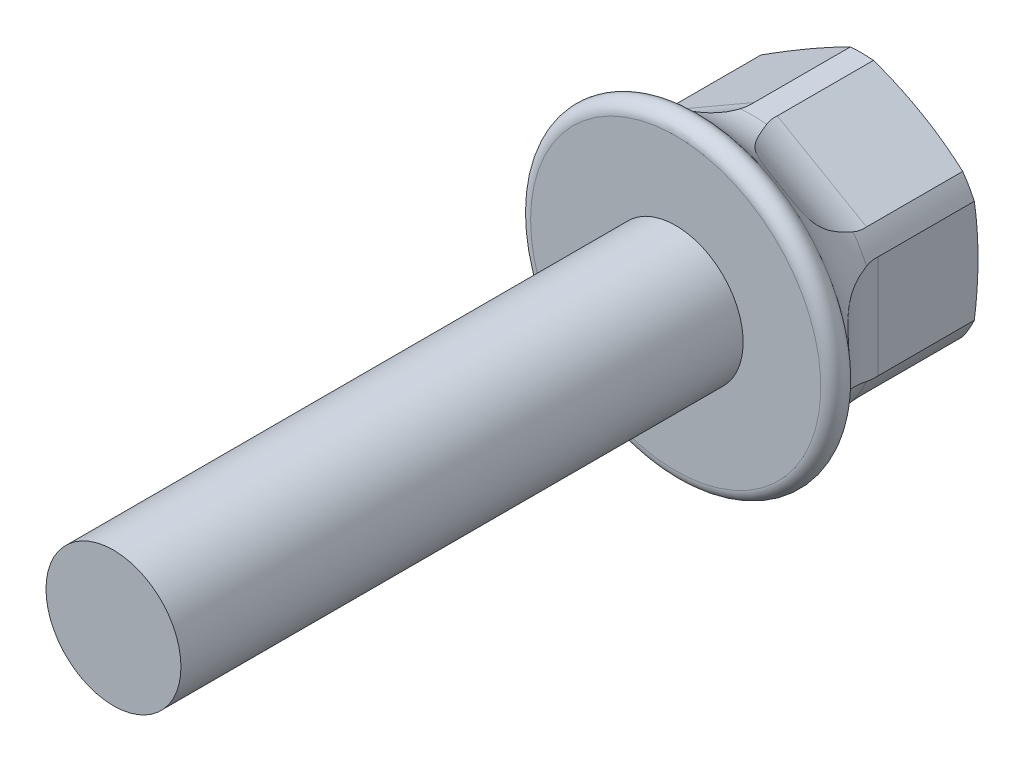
ISO-10303-21;
HEADER;
FILE_DESCRIPTION(('STEP AP214'),'2;1');
FILE_NAME('part.step','',(''),(''),'','','');
FILE_SCHEMA(('AUTOMOTIVE_DESIGN { 1 0 10303 214 1 1 1 1 }'));
ENDSEC;
DATA;
#1=APPLICATION_CONTEXT('core data for automotive mechanical design processes');
#2=APPLICATION_PROTOCOL_DEFINITION('international standard','automotive_design',2000,#1);
#3=PRODUCT_CONTEXT('',#1,'mechanical');
#4=PRODUCT('Part','Part','',(#3));
#5=PRODUCT_RELATED_PRODUCT_CATEGORY('part','',(#4));
#6=PRODUCT_DEFINITION_FORMATION('','',#4);
#7=PRODUCT_DEFINITION_CONTEXT('part definition',#1,'design');
#8=PRODUCT_DEFINITION('design','',#6,#7);
#9=PRODUCT_DEFINITION_SHAPE('','',#8);
#10=(LENGTH_UNIT() NAMED_UNIT(*) SI_UNIT(.MILLI.,.METRE.));
#11=(NAMED_UNIT(*) PLANE_ANGLE_UNIT() SI_UNIT($,.RADIAN.));
#12=(NAMED_UNIT(*) SI_UNIT($,.STERADIAN.) SOLID_ANGLE_UNIT());
#13=UNCERTAINTY_MEASURE_WITH_UNIT(LENGTH_MEASURE(1.E-05),#10,'distance_accuracy_value','');
#14=(GEOMETRIC_REPRESENTATION_CONTEXT(3) GLOBAL_UNCERTAINTY_ASSIGNED_CONTEXT((#13)) GLOBAL_UNIT_ASSIGNED_CONTEXT((#10,
#11,#12)) REPRESENTATION_CONTEXT('',''));
#15=CARTESIAN_POINT('',(0.,0.,0.));
#16=DIRECTION('',(0.,0.,1.));
#17=DIRECTION('',(1.,0.,0.));
#18=AXIS2_PLACEMENT_3D('',#15,#16,#17);
#19=CARTESIAN_POINT('',(0.,0.,0.));
#20=DIRECTION('',(0.,0.,1.));
#21=DIRECTION('',(1.,0.,0.));
#22=AXIS2_PLACEMENT_3D('',#19,#20,#21);
#23=CYLINDRICAL_SURFACE('',#22,5.5);
#24=CARTESIAN_POINT('',(0.,0.,-3.44949995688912));
#25=DIRECTION('',(0.,0.,1.));
#26=DIRECTION('',(1.,0.,0.));
#27=AXIS2_PLACEMENT_3D('',#24,#25,#26);
#28=CIRCLE('',#27,5.5);
#29=CARTESIAN_POINT('',(0.594175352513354,5.46781086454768,-3.44949995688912));
#30=VERTEX_POINT('',#29);
#31=CARTESIAN_POINT('',(-0.594175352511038,5.46781086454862,-3.44949995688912));
#32=VERTEX_POINT('',#31);
#33=EDGE_CURVE('E239',#30,#32,#28,.T.);
#34=ORIENTED_EDGE('',*,*,#33,.F.);
#35=CARTESIAN_POINT('',(4.48662747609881,3.18122207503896,-3.9));
#36=CARTESIAN_POINT('',(4.48662338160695,3.18123162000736,-3.82769104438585));
#37=CARTESIAN_POINT('',(4.48298582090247,3.18637779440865,-3.75526240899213));
#38=CARTESIAN_POINT('',(4.46852038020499,3.20662906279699,-3.61243972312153));
#39=CARTESIAN_POINT('',(4.4576739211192,3.2217598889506,-3.54205142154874));
#40=CARTESIAN_POINT('',(4.42916215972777,3.26084333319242,-3.40559085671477));
#41=CARTESIAN_POINT('',(4.41152735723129,3.28475647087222,-3.3395008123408));
#42=CARTESIAN_POINT('',(4.36991497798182,3.33991488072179,-3.21267759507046));
#43=CARTESIAN_POINT('',(4.34593950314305,3.37115772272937,-3.15194265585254));
#44=CARTESIAN_POINT('',(4.2895068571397,3.44273124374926,-3.03082916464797));
#45=CARTESIAN_POINT('',(4.25644287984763,3.48365703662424,-2.97108817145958));
#46=CARTESIAN_POINT('',(4.18406045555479,3.5702711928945,-2.85937650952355));
#47=CARTESIAN_POINT('',(4.14473720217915,3.6159632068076,-2.80741187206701));
#48=CARTESIAN_POINT('',(4.03842174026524,3.73502100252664,-2.68589604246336));
#49=CARTESIAN_POINT('',(3.96774521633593,3.81031656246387,-2.6214439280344));
#50=CARTESIAN_POINT('',(3.81572313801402,3.96256067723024,-2.50903707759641));
#51=CARTESIAN_POINT('',(3.73435315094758,4.03951266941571,-2.46112106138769));
#52=CARTESIAN_POINT('',(3.59327668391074,4.16459845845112,-2.3944705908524));
#53=CARTESIAN_POINT('',(3.53606064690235,4.21331743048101,-2.37140558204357));
#54=CARTESIAN_POINT('',(3.41842501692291,4.3093071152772,-2.33107107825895));
#55=CARTESIAN_POINT('',(3.3580045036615,4.35657740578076,-2.31380325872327));
#56=CARTESIAN_POINT('',(3.2343751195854,4.44913272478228,-2.28473206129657));
#57=CARTESIAN_POINT('',(3.17116552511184,4.49441723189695,-2.27293011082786));
#58=CARTESIAN_POINT('',(3.0423533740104,4.58259675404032,-2.25455645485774));
#59=CARTESIAN_POINT('',(2.97674990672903,4.62549084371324,-2.24798676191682));
#60=CARTESIAN_POINT('',(2.77526731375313,4.75111190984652,-2.2357986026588));
#61=CARTESIAN_POINT('',(2.63619475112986,4.82966607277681,-2.2380382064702));
#62=CARTESIAN_POINT('',(2.35332094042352,4.97363608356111,-2.26349788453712));
#63=CARTESIAN_POINT('',(2.20952175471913,5.03905757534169,-2.28670892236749));
#64=CARTESIAN_POINT('',(1.94344050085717,5.14688605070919,-2.35081142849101));
#65=CARTESIAN_POINT('',(1.8211947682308,5.19127753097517,-2.38849643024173));
#66=CARTESIAN_POINT('',(1.58051047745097,5.26952557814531,-2.48248449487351));
#67=CARTESIAN_POINT('',(1.46206668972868,5.30339722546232,-2.53876066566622));
#68=CARTESIAN_POINT('',(1.26346880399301,5.3536329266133,-2.65543015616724));
#69=CARTESIAN_POINT('',(1.18118519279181,5.37225786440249,-2.71121547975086));
#70=CARTESIAN_POINT('',(1.02542147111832,5.40414631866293,-2.83526195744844));
#71=CARTESIAN_POINT('',(0.951929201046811,5.41741730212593,-2.90350554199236));
#72=CARTESIAN_POINT('',(0.830491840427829,5.43721886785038,-3.0384151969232));
#73=CARTESIAN_POINT('',(0.780340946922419,5.44454721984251,-3.10297100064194));
#74=CARTESIAN_POINT('',(0.691060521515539,5.45659848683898,-3.23958063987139));
#75=CARTESIAN_POINT('',(0.65192682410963,5.46132238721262,-3.3116316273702));
#76=CARTESIAN_POINT('',(0.586847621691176,5.46870222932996,-3.46221484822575));
#77=CARTESIAN_POINT('',(0.560994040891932,5.4713438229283,-3.54078799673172));
#78=CARTESIAN_POINT('',(0.524778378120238,5.47493857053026,-3.70147165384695));
#79=CARTESIAN_POINT('',(0.51440681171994,5.4758927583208,-3.7835799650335));
#80=CARTESIAN_POINT('',(0.510192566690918,5.47628504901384,-3.93852871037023));
#81=CARTESIAN_POINT('',(0.514551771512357,5.47588804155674,-4.0113251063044));
#82=CARTESIAN_POINT('',(0.535646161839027,5.47386466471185,-4.15506463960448));
#83=CARTESIAN_POINT('',(0.552379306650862,5.47223849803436,-4.22600808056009));
#84=CARTESIAN_POINT('',(0.596800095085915,5.4675689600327,-4.36278288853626));
#85=CARTESIAN_POINT('',(0.624271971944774,5.46455330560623,-4.42868610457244));
#86=CARTESIAN_POINT('',(0.688759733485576,5.45679952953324,-4.55550173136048));
#87=CARTESIAN_POINT('',(0.725777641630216,5.45206104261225,-4.61641308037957));
#88=CARTESIAN_POINT('',(0.811879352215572,5.43993723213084,-4.7382473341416));
#89=CARTESIAN_POINT('',(0.861803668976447,5.43233310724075,-4.79855144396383));
#90=CARTESIAN_POINT('',(0.969092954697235,5.41422476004,-4.91159832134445));
#91=CARTESIAN_POINT('',(1.02646285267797,5.40371861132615,-4.96433603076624));
#92=CARTESIAN_POINT('',(1.17749954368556,5.37327059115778,-5.08733850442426));
#93=CARTESIAN_POINT('',(1.27471038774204,5.3512517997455,-5.15275097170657));
#94=CARTESIAN_POINT('',(1.47629007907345,5.29919404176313,-5.26751978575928));
#95=CARTESIAN_POINT('',(1.58067500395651,5.26913659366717,-5.31683854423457));
#96=CARTESIAN_POINT('',(1.75548646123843,5.21282437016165,-5.38625013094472));
#97=CARTESIAN_POINT('',(1.82505409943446,5.18890180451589,-5.41053624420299));
#98=CARTESIAN_POINT('',(1.96470986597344,5.1376508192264,-5.45337257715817));
#99=CARTESIAN_POINT('',(2.03479814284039,5.11032138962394,-5.47192109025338));
#100=CARTESIAN_POINT('',(2.24483567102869,5.02330517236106,-5.51949908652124));
#101=CARTESIAN_POINT('',(2.38460423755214,4.95857567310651,-5.54047867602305));
#102=CARTESIAN_POINT('',(2.66124038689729,4.81585315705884,-5.56278087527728));
#103=CARTESIAN_POINT('',(2.79803784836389,4.73768361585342,-5.563817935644));
#104=CARTESIAN_POINT('',(3.06347416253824,4.57052120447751,-5.5456077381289));
#105=CARTESIAN_POINT('',(3.19211517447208,4.48153121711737,-5.52636587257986));
#106=CARTESIAN_POINT('',(3.42390208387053,4.30645056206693,-5.46949312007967));
#107=CARTESIAN_POINT('',(3.52827617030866,4.22121381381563,-5.43424497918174));
#108=CARTESIAN_POINT('',(3.72583449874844,4.04787795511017,-5.34449880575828));
#109=CARTESIAN_POINT('',(3.81903362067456,3.95978285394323,-5.29002676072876));
#110=CARTESIAN_POINT('',(3.96930066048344,3.80827952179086,-5.17606257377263));
#111=CARTESIAN_POINT('',(4.02950692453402,3.74433073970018,-5.12143493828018));
#112=CARTESIAN_POINT('',(4.14072736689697,3.62094398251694,-4.99924156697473));
#113=CARTESIAN_POINT('',(4.19175605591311,3.56149897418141,-4.93169661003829));
#114=CARTESIAN_POINT('',(4.27422459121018,3.46184430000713,-4.79788135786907));
#115=CARTESIAN_POINT('',(4.30754425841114,3.42013813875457,-4.73389205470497));
#116=CARTESIAN_POINT('',(4.36635045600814,3.34473809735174,-4.59793679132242));
#117=CARTESIAN_POINT('',(4.39183476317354,3.31104649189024,-4.52596857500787));
#118=CARTESIAN_POINT('',(4.43430755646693,3.25395252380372,-4.37492230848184));
#119=CARTESIAN_POINT('',(4.45122265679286,3.23063923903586,-4.29578946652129));
#120=CARTESIAN_POINT('',(4.47554685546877,3.19686306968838,-4.13357241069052));
#121=CARTESIAN_POINT('',(4.48298909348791,3.18635539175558,-4.05050303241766));
#122=CARTESIAN_POINT('',(4.48628127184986,3.18170917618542,-3.94479214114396));
#123=CARTESIAN_POINT('',(4.48662874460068,3.1812191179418,-3.9224018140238));
#124=CARTESIAN_POINT('',(4.48662747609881,3.18122207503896,-3.9));
#125=B_SPLINE_CURVE_WITH_KNOTS('',3,(#35,#36,#37,#38,#39,#40,#41,#42,#43,#44,#45,#46,#47,#48,
#49,#50,#51,#52,#53,#54,#55,#56,#57,#58,#59,#60,#61,#62,#63,#64,#65,#66,#67,#68,#69,#70,#71,#72,
#73,#74,#75,#76,#77,#78,#79,#80,#81,#82,#83,#84,#85,#86,#87,#88,#89,#90,#91,#92,#93,#94,#95,#96,
#97,#98,#99,#100,#101,#102,#103,#104,#105,#106,#107,#108,#109,#110,#111,#112,#113,#114,#115,
#116,#117,#118,#119,#120,#121,#122,#123,#124),.UNSPECIFIED.,.T.,.F.,(4,2,2,2,2,2,2,2,2,2,2,2,2,
2,2,2,2,2,2,2,2,2,2,2,2,2,2,2,2,2,2,2,2,2,2,2,2,2,2,2,2,2,2,2,4),(0.,0.216867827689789,
0.434296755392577,0.650759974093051,0.867151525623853,1.10508806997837,1.34320821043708,
1.70640107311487,2.07043868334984,2.30598904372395,2.54160742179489,2.77728729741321,
3.01305778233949,3.49017853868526,3.96709380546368,4.37185029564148,4.77602385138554,
5.07838658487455,5.3803261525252,5.62556584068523,5.87071268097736,6.1175342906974,
6.36420463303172,6.5819058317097,6.79957113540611,7.01307093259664,7.22661602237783,
7.46170492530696,7.69695026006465,8.05264942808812,8.40917351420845,8.641305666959,
8.87350679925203,9.33775501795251,9.80864575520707,10.2794113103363,10.6957596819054,
11.1115473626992,11.4207736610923,11.7295066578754,11.9785171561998,12.227598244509,
12.4787778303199,12.7290762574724,12.7962634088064),.UNSPECIFIED.);
#126=CARTESIAN_POINT('',(0.515686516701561,5.47577094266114,-4.));
#127=VERTEX_POINT('',#126);
#128=EDGE_CURVE('E406',#30,#127,#125,.T.);
#129=ORIENTED_EDGE('',*,*,#128,.T.);
#130=DIRECTION('',(0.,0.,1.));
#131=VECTOR('',#130,1.);
#132=CARTESIAN_POINT('',(0.515686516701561,5.47577094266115,-14.));
#133=LINE('',#132,#131);
#134=CARTESIAN_POINT('',(0.515686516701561,5.47577094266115,-8.27767862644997));
#135=VERTEX_POINT('',#134);
#136=EDGE_CURVE('E183',#135,#127,#133,.T.);
#137=ORIENTED_EDGE('',*,*,#136,.F.);
#138=CARTESIAN_POINT('',(0.,0.,-8.27767862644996));
#139=DIRECTION('',(0.,0.,1.));
#140=DIRECTION('',(1.,0.,0.));
#141=AXIS2_PLACEMENT_3D('',#138,#139,#140);
#142=CIRCLE('',#141,5.5);
#143=CARTESIAN_POINT('',(-0.515686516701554,5.47577094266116,-8.27767862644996));
#144=VERTEX_POINT('',#143);
#145=EDGE_CURVE('E232',#135,#144,#142,.T.);
#146=ORIENTED_EDGE('',*,*,#145,.T.);
#147=DIRECTION('',(0.,0.,1.));
#148=VECTOR('',#147,1.);
#149=CARTESIAN_POINT('',(-0.515686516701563,5.47577094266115,-14.));
#150=LINE('',#149,#148);
#151=CARTESIAN_POINT('',(-0.515686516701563,5.47577094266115,-4.));
#152=VERTEX_POINT('',#151);
#153=EDGE_CURVE('E172',#144,#152,#150,.T.);
#154=ORIENTED_EDGE('',*,*,#153,.T.);
#155=CARTESIAN_POINT('',(-0.511705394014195,5.47614440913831,-3.9));
#156=CARTESIAN_POINT('',(-0.511715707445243,5.47614563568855,-3.82769104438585));
#157=CARTESIAN_POINT('',(-0.51799120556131,5.47556850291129,-3.75526240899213));
#158=CARTESIAN_POINT('',(-0.54276203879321,5.47316669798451,-3.61243972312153));
#159=CARTESIAN_POINT('',(-0.561288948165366,5.47133880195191,-3.54205142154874));
#160=CARTESIAN_POINT('',(-0.609392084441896,5.4661886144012,-3.40559085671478));
#161=CARTESIAN_POINT('',(-0.638918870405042,5.46287299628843,-3.33950081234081));
#162=CARTESIAN_POINT('',(-0.707493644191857,5.45441482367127,-3.21267759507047));
#163=CARTESIAN_POINT('',(-0.746538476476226,5.44927287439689,-3.15194265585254));
#164=CARTESIAN_POINT('',(-0.836739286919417,5.43618752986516,-3.03082916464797));
#165=CARTESIAN_POINT('',(-0.888714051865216,5.42801618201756,-2.97108817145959));
#166=CARTESIAN_POINT('',(-0.999915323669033,5.40863824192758,-2.85937650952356));
#167=CARTESIAN_POINT('',(-1.05914739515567,5.39742931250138,-2.80741187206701));
#168=CARTESIAN_POINT('',(-1.21541220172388,5.36488631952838,-2.68589604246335));
#169=CARTESIAN_POINT('',(-1.31595833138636,5.34132643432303,-2.62144392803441));
#170=CARTESIAN_POINT('',(-1.52381664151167,5.28579350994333,-2.50903707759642));
#171=CARTESIAN_POINT('',(-1.63114401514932,5.25380103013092,-2.46112106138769));
#172=CARTESIAN_POINT('',(-1.81000971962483,5.19416812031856,-2.3944705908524));
#173=CARTESIAN_POINT('',(-1.88080960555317,5.16897706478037,-2.37140558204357));
#174=CARTESIAN_POINT('',(-2.02275692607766,5.11509646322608,-2.33107107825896));
#175=CARTESIAN_POINT('',(-2.09390445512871,5.08640590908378,-2.31380325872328));
#176=CARTESIAN_POINT('',(-2.23587440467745,5.02561738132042,-2.28473206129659));
#177=CARTESIAN_POINT('',(-2.30669673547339,4.99351852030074,-2.27293011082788));
#178=CARTESIAN_POINT('',(-2.44746851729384,4.92605368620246,-2.25455645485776));
#179=CARTESIAN_POINT('',(-2.51741762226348,4.89068646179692,-2.24798676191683));
#180=CARTESIAN_POINT('',(-2.72694995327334,4.77900795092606,-2.2357986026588));
#181=CARTESIAN_POINT('',(-2.86451613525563,4.69784466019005,-2.23803820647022));
#182=CARTESIAN_POINT('',(-3.13063472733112,4.5248537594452,-2.26349788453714));
#183=CARTESIAN_POINT('',(-3.25919099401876,4.43303075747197,-2.28670892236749));
#184=CARTESIAN_POINT('',(-3.48561381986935,4.25651186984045,-2.35081142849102));
#185=CARTESIAN_POINT('',(-3.58518083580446,4.17283970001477,-2.38849643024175));
#186=CARTESIAN_POINT('',(-3.77328777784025,4.00352501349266,-2.48248449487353));
#187=CARTESIAN_POINT('',(-3.86184337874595,3.9178855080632,-2.53876066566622));
#188=CARTESIAN_POINT('',(-4.00464771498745,3.77101254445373,-2.65543015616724));
#189=CARTESIAN_POINT('',(-4.06191918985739,3.70906531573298,-2.71121547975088));
#190=CARTESIAN_POINT('',(-4.16741726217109,3.59011420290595,-2.83526195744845));
#191=CARTESIAN_POINT('',(-4.21565640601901,3.53310352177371,-2.90350554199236));
#192=CARTESIAN_POINT('',(-4.29352374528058,3.43783646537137,-3.0384151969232));
#193=CARTESIAN_POINT('',(-4.32494573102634,3.39806869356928,-3.10297100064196));
#194=CARTESIAN_POINT('',(-4.38002264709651,3.32677521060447,-3.23958063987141));
#195=CARTESIAN_POINT('',(-4.403680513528,3.29524638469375,-3.31163162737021));
#196=CARTESIAN_POINT('',(-4.44261124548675,3.24257606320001,-3.46221484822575));
#197=CARTESIAN_POINT('',(-4.457825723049,3.22150700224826,-3.54078799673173));
#198=CARTESIAN_POINT('',(-4.47904669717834,3.19194069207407,-3.70147165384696));
#199=CARTESIAN_POINT('',(-4.48505883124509,3.18343574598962,-3.78357996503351));
#200=CARTESIAN_POINT('',(-4.48750568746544,3.17998224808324,-3.93852871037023));
#201=CARTESIAN_POINT('',(-4.48498226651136,3.18355892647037,-4.0113251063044));
#202=CARTESIAN_POINT('',(-4.47268277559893,3.20081551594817,-4.15506463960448));
#203=CARTESIAN_POINT('',(-4.46290790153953,3.21449376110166,-4.22600808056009));
#204=CARTESIAN_POINT('',(-4.43665356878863,3.25062852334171,-4.36278288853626));
#205=CARTESIAN_POINT('',(-4.42030599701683,3.27291203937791,-4.42868610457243));
#206=CARTESIAN_POINT('',(-4.38134714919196,3.32488319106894,-4.55550173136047));
#207=CARTESIAN_POINT('',(-4.35873454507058,3.35457239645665,-4.61641308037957));
#208=CARTESIAN_POINT('',(-4.30518416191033,3.42307675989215,-4.7382473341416));
#209=CARTESIAN_POINT('',(-4.27363663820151,3.46251042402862,-4.79855144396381));
#210=CARTESIAN_POINT('',(-4.20430970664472,3.54637149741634,-4.91159832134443));
#211=CARTESIAN_POINT('',(-4.16652616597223,3.59080221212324,-4.96433603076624));
#212=CARTESIAN_POINT('',(-4.06463906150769,3.70637981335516,-5.08733850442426));
#213=CARTESIAN_POINT('',(-3.99696480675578,3.77955747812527,-5.15275097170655));
#214=CARTESIAN_POINT('',(-3.85109162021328,3.92810173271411,-5.26751978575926));
#215=CARTESIAN_POINT('',(-3.77286864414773,4.00347300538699,-5.31683854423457));
#216=CARTESIAN_POINT('',(-3.6366950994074,4.12670805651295,-5.38625013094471));
#217=CARTESIAN_POINT('',(-3.58119373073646,4.17499411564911,-5.41053624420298));
#218=CARTESIAN_POINT('',(-3.46698119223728,4.27031406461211,-5.45337257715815));
#219=CARTESIAN_POINT('',(-3.40826907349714,4.31734757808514,-5.47192109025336));
#220=CARTESIAN_POINT('',(-3.22789205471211,4.45573730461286,-5.51949908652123));
#221=CARTESIAN_POINT('',(-3.1019503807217,4.54441568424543,-5.54047867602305));
#222=CARTESIAN_POINT('',(-2.8400309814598,4.7126283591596,-5.56278087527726));
#223=CARTESIAN_POINT('',(-2.70393544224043,4.79201366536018,-5.56381793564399));
#224=CARTESIAN_POINT('',(-2.42645039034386,4.93830705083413,-5.54560773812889));
#225=CARTESIAN_POINT('',(-2.28506229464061,5.00521844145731,-5.52636587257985));
#226=CARTESIAN_POINT('',(-2.01754454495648,5.11841146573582,-5.46949312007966));
#227=CARTESIAN_POINT('',(-1.89154031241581,5.16618370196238,-5.43424497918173));
#228=CARTESIAN_POINT('',(-1.6426478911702,5.2506063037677,-5.34449880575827));
#229=CARTESIAN_POINT('',(-1.51975573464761,5.28727156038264,-5.29002676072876));
#230=CARTESIAN_POINT('',(-1.31341648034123,5.34165496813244,-5.17606257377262));
#231=CARTESIAN_POINT('',(-1.22793207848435,5.36182073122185,-5.12143493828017));
#232=CARTESIAN_POINT('',(-1.0654657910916,5.39644708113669,-4.99924156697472));
#233=CARTESIAN_POINT('',(-0.988470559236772,5.41091671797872,-4.93169661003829));
#234=CARTESIAN_POINT('',(-0.860932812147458,5.43250922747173,-4.79788135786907));
#235=CARTESIAN_POINT('',(-0.808154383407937,5.44051182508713,-4.73389205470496));
#236=CARTESIAN_POINT('',(-0.713452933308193,5.45373946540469,-4.59793679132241));
#237=CARTESIAN_POINT('',(-0.671532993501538,5.45896372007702,-4.52596857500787));
#238=CARTESIAN_POINT('',(-0.600851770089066,5.46719925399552,-4.37492230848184));
#239=CARTESIAN_POINT('',(-0.572204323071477,5.47019151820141,-4.29578946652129));
#240=CARTESIAN_POINT('',(-0.530791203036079,5.4743688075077,-4.13357241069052));
#241=CARTESIAN_POINT('',(-0.517970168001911,5.47556013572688,-4.05050303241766));
#242=CARTESIAN_POINT('',(-0.512300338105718,5.47608813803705,-3.94479214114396));
#243=CARTESIAN_POINT('',(-0.511702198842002,5.47614402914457,-3.9224018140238));
#244=CARTESIAN_POINT('',(-0.511705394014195,5.47614440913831,-3.9));
#245=B_SPLINE_CURVE_WITH_KNOTS('',3,(#155,#156,#157,#158,#159,#160,#161,#162,#163,#164,#165,
#166,#167,#168,#169,#170,#171,#172,#173,#174,#175,#176,#177,#178,#179,#180,#181,#182,#183,#184,
#185,#186,#187,#188,#189,#190,#191,#192,#193,#194,#195,#196,#197,#198,#199,#200,#201,#202,#203,
#204,#205,#206,#207,#208,#209,#210,#211,#212,#213,#214,#215,#216,#217,#218,#219,#220,#221,#222,
#223,#224,#225,#226,#227,#228,#229,#230,#231,#232,#233,#234,#235,#236,#237,#238,#239,#240,#241,
#242,#243,#244),.UNSPECIFIED.,.T.,.F.,(4,2,2,2,2,2,2,2,2,2,2,2,2,2,2,2,2,2,2,2,2,2,2,2,2,2,2,2,
2,2,2,2,2,2,2,2,2,2,2,2,2,2,2,2,4),(0.,0.216867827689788,0.434296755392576,0.650759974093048,
0.867151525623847,1.10508806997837,1.34320821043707,1.70640107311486,2.07043868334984,
2.30598904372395,2.54160742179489,2.7772872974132,3.01305778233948,3.49017853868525,
3.96709380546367,4.37185029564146,4.77602385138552,5.07838658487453,5.38032615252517,
5.6255658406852,5.87071268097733,6.11753429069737,6.36420463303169,6.58190583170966,
6.79957113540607,7.0130709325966,7.22661602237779,7.46170492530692,7.6969502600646,
8.05264942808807,8.4091735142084,8.64130566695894,8.87350679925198,9.33775501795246,
9.80864575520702,10.2794113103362,10.6957596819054,11.1115473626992,11.4207736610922,
11.7295066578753,11.9785171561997,12.2275982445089,12.4787778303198,12.7290762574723,
12.7962634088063),.UNSPECIFIED.);
#246=EDGE_CURVE('E148',#152,#32,#245,.T.);
#247=ORIENTED_EDGE('',*,*,#246,.T.);
#248=EDGE_LOOP('',(#34,#129,#137,#146,#154,#247));
#249=FACE_BOUND('',#248,.T.);
#250=ADVANCED_FACE('F15',(#249),#23,.T.);
#251=CARTESIAN_POINT('',(4.4381754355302,-3.24847638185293,-3.44949995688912));
#252=VERTEX_POINT('',#251);
#253=CARTESIAN_POINT('',(5.03235078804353,-2.21933448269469,-3.44949995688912));
#254=VERTEX_POINT('',#253);
#255=EDGE_CURVE('E231',#252,#254,#28,.T.);
#256=ORIENTED_EDGE('',*,*,#255,.F.);
#257=CARTESIAN_POINT('',(0.511705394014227,-5.47614440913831,-3.9));
#258=CARTESIAN_POINT('',(0.511715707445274,-5.47614563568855,-3.82769104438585));
#259=CARTESIAN_POINT('',(0.517991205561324,-5.47556850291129,-3.75526240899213));
#260=CARTESIAN_POINT('',(0.542762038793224,-5.47316669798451,-3.61243972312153));
#261=CARTESIAN_POINT('',(0.561288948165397,-5.47133880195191,-3.54205142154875));
#262=CARTESIAN_POINT('',(0.609392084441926,-5.4661886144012,-3.40559085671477));
#263=CARTESIAN_POINT('',(0.638918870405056,-5.46287299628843,-3.3395008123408));
#264=CARTESIAN_POINT('',(0.70749364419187,-5.45441482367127,-3.21267759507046));
#265=CARTESIAN_POINT('',(0.746538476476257,-5.44927287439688,-3.15194265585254));
#266=CARTESIAN_POINT('',(0.836739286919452,-5.43618752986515,-3.03082916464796));
#267=CARTESIAN_POINT('',(0.888714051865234,-5.42801618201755,-2.97108817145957));
#268=CARTESIAN_POINT('',(0.999915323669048,-5.40863824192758,-2.85937650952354));
#269=CARTESIAN_POINT('',(1.0591473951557,-5.39742931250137,-2.80741187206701));
#270=CARTESIAN_POINT('',(1.21541220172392,-5.36488631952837,-2.68589604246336));
#271=CARTESIAN_POINT('',(1.31595833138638,-5.34132643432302,-2.62144392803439));
#272=CARTESIAN_POINT('',(1.52381664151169,-5.28579350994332,-2.5090370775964));
#273=CARTESIAN_POINT('',(1.63114401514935,-5.25380103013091,-2.46112106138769));
#274=CARTESIAN_POINT('',(1.81000971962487,-5.19416812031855,-2.3944705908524));
#275=CARTESIAN_POINT('',(1.88080960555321,-5.16897706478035,-2.37140558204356));
#276=CARTESIAN_POINT('',(2.02275692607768,-5.11509646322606,-2.33107107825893));
#277=CARTESIAN_POINT('',(2.09390445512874,-5.08640590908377,-2.31380325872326));
#278=CARTESIAN_POINT('',(2.23587440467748,-5.02561738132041,-2.28473206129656));
#279=CARTESIAN_POINT('',(2.30669673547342,-4.99351852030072,-2.27293011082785));
#280=CARTESIAN_POINT('',(2.44746851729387,-4.92605368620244,-2.25455645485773));
#281=CARTESIAN_POINT('',(2.51741762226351,-4.8906864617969,-2.24798676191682));
#282=CARTESIAN_POINT('',(2.72694995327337,-4.77900795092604,-2.2357986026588));
#283=CARTESIAN_POINT('',(2.86451613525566,-4.69784466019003,-2.23803820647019));
#284=CARTESIAN_POINT('',(3.13063472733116,-4.52485375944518,-2.26349788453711));
#285=CARTESIAN_POINT('',(3.2591909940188,-4.43303075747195,-2.28670892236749));
#286=CARTESIAN_POINT('',(3.48561381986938,-4.25651186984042,-2.35081142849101));
#287=CARTESIAN_POINT('',(3.5851808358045,-4.17283970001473,-2.38849643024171));
#288=CARTESIAN_POINT('',(3.77328777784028,-4.00352501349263,-2.4824844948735));
#289=CARTESIAN_POINT('',(3.86184337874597,-3.91788550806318,-2.53876066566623));
#290=CARTESIAN_POINT('',(4.00464771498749,-3.77101254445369,-2.65543015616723));
#291=CARTESIAN_POINT('',(4.06191918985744,-3.70906531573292,-2.71121547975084));
#292=CARTESIAN_POINT('',(4.16741726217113,-3.5901142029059,-2.83526195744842));
#293=CARTESIAN_POINT('',(4.21565640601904,-3.53310352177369,-2.90350554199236));
#294=CARTESIAN_POINT('',(4.29352374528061,-3.43783646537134,-3.0384151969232));
#295=CARTESIAN_POINT('',(4.32494573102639,-3.39806869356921,-3.10297100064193));
#296=CARTESIAN_POINT('',(4.38002264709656,-3.32677521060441,-3.23958063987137));
#297=CARTESIAN_POINT('',(4.40368051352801,-3.29524638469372,-3.3116316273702));
#298=CARTESIAN_POINT('',(4.44261124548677,-3.24257606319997,-3.46221484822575));
#299=CARTESIAN_POINT('',(4.45782572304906,-3.22150700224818,-3.54078799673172));
#300=CARTESIAN_POINT('',(4.4790466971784,-3.19194069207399,-3.70147165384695));
#301=CARTESIAN_POINT('',(4.48505883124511,-3.18343574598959,-3.7835799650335));
#302=CARTESIAN_POINT('',(4.48750568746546,-3.1799822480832,-3.93852871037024));
#303=CARTESIAN_POINT('',(4.48498226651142,-3.18355892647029,-4.01132510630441));
#304=CARTESIAN_POINT('',(4.47268277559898,-3.20081551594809,-4.15506463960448));
#305=CARTESIAN_POINT('',(4.46290790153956,-3.21449376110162,-4.22600808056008));
#306=CARTESIAN_POINT('',(4.43665356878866,-3.25062852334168,-4.36278288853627));
#307=CARTESIAN_POINT('',(4.42030599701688,-3.27291203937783,-4.42868610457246));
#308=CARTESIAN_POINT('',(4.38134714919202,-3.32488319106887,-4.5555017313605));
#309=CARTESIAN_POINT('',(4.35873454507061,-3.35457239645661,-4.61641308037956));
#310=CARTESIAN_POINT('',(4.30518416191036,-3.42307675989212,-4.7382473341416));
#311=CARTESIAN_POINT('',(4.27363663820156,-3.46251042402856,-4.79855144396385));
#312=CARTESIAN_POINT('',(4.20430970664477,-3.54637149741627,-4.91159832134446));
#313=CARTESIAN_POINT('',(4.16652616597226,-3.5908022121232,-4.96433603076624));
#314=CARTESIAN_POINT('',(4.06463906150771,-3.70637981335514,-5.08733850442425));
#315=CARTESIAN_POINT('',(3.99696480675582,-3.77955747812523,-5.15275097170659));
#316=CARTESIAN_POINT('',(3.85109162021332,-3.92810173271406,-5.2675197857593));
#317=CARTESIAN_POINT('',(3.77286864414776,-4.00347300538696,-5.31683854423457));
#318=CARTESIAN_POINT('',(3.63669509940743,-4.12670805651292,-5.38625013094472));
#319=CARTESIAN_POINT('',(3.58119373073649,-4.17499411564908,-5.41053624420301));
#320=CARTESIAN_POINT('',(3.46698119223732,-4.27031406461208,-5.45337257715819));
#321=CARTESIAN_POINT('',(3.40826907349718,-4.31734757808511,-5.4719210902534));
#322=CARTESIAN_POINT('',(3.22789205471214,-4.45573730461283,-5.51949908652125));
#323=CARTESIAN_POINT('',(3.10195038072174,-4.5444156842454,-5.54047867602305));
#324=CARTESIAN_POINT('',(2.84003098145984,-4.71262835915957,-5.56278087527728));
#325=CARTESIAN_POINT('',(2.70393544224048,-4.79201366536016,-5.56381793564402));
#326=CARTESIAN_POINT('',(2.4264503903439,-4.93830705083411,-5.54560773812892));
#327=CARTESIAN_POINT('',(2.28506229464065,-5.00521844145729,-5.52636587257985));
#328=CARTESIAN_POINT('',(2.01754454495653,-5.1184114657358,-5.46949312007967));
#329=CARTESIAN_POINT('',(1.89154031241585,-5.16618370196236,-5.43424497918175));
#330=CARTESIAN_POINT('',(1.64264789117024,-5.25060630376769,-5.34449880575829));
#331=CARTESIAN_POINT('',(1.51975573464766,-5.28727156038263,-5.29002676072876));
#332=CARTESIAN_POINT('',(1.31341648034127,-5.34165496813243,-5.17606257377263));
#333=CARTESIAN_POINT('',(1.22793207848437,-5.36182073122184,-5.12143493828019));
#334=CARTESIAN_POINT('',(1.06546579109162,-5.39644708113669,-4.99924156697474));
#335=CARTESIAN_POINT('',(0.988470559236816,-5.41091671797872,-4.93169661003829));
#336=CARTESIAN_POINT('',(0.860932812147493,-5.43250922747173,-4.79788135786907));
#337=CARTESIAN_POINT('',(0.808154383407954,-5.44051182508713,-4.73389205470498));
#338=CARTESIAN_POINT('',(0.713452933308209,-5.45373946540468,-4.59793679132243));
#339=CARTESIAN_POINT('',(0.671532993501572,-5.45896372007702,-4.52596857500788));
#340=CARTESIAN_POINT('',(0.600851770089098,-5.46719925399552,-4.37492230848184));
#341=CARTESIAN_POINT('',(0.57220432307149,-5.47019151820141,-4.2957894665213));
#342=CARTESIAN_POINT('',(0.530791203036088,-5.47436880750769,-4.13357241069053));
#343=CARTESIAN_POINT('',(0.517970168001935,-5.47556013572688,-4.05050303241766));
#344=CARTESIAN_POINT('',(0.51230033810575,-5.47608813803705,-3.94479214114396));
#345=CARTESIAN_POINT('',(0.511702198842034,-5.47614402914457,-3.9224018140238));
#346=CARTESIAN_POINT('',(0.511705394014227,-5.47614440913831,-3.9));
#347=B_SPLINE_CURVE_WITH_KNOTS('',3,(#257,#258,#259,#260,#261,#262,#263,#264,#265,#266,#267,
#268,#269,#270,#271,#272,#273,#274,#275,#276,#277,#278,#279,#280,#281,#282,#283,#284,#285,#286,
#287,#288,#289,#290,#291,#292,#293,#294,#295,#296,#297,#298,#299,#300,#301,#302,#303,#304,#305,
#306,#307,#308,#309,#310,#311,#312,#313,#314,#315,#316,#317,#318,#319,#320,#321,#322,#323,#324,
#325,#326,#327,#328,#329,#330,#331,#332,#333,#334,#335,#336,#337,#338,#339,#340,#341,#342,#343,
#344,#345,#346),.UNSPECIFIED.,.T.,.F.,(4,2,2,2,2,2,2,2,2,2,2,2,2,2,2,2,2,2,2,2,2,2,2,2,2,2,2,2,
2,2,2,2,2,2,2,2,2,2,2,2,2,2,2,2,4),(0.,0.21686782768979,0.434296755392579,0.650759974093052,
0.867151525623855,1.10508806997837,1.34320821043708,1.70640107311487,2.07043868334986,
2.30598904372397,2.54160742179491,2.77728729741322,3.01305778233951,3.49017853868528,
3.9670938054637,4.3718502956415,4.77602385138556,5.07838658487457,5.38032615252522,
5.62556584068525,5.87071268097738,6.11753429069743,6.36420463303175,6.58190583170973,
6.79957113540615,7.01307093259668,7.22661602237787,7.46170492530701,7.6969502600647,
8.05264942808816,8.4091735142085,8.64130566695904,8.87350679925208,9.33775501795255,
9.80864575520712,10.2794113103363,10.6957596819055,11.1115473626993,11.4207736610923,
11.7295066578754,11.9785171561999,12.227598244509,12.4787778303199,12.7290762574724,
12.7962634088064),.UNSPECIFIED.);
#348=CARTESIAN_POINT('',(4.48431348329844,-3.1844830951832,-4.));
#349=VERTEX_POINT('',#348);
#350=EDGE_CURVE('E400',#252,#349,#347,.T.);
#351=ORIENTED_EDGE('',*,*,#350,.T.);
#352=DIRECTION('',(0.,0.,1.));
#353=VECTOR('',#352,1.);
#354=CARTESIAN_POINT('',(4.48431348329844,-3.18448309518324,-14.));
#355=LINE('',#354,#353);
#356=CARTESIAN_POINT('',(4.48431348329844,-3.18448309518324,-8.27767862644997));
#357=VERTEX_POINT('',#356);
#358=EDGE_CURVE('E219',#357,#349,#355,.T.);
#359=ORIENTED_EDGE('',*,*,#358,.F.);
#360=CARTESIAN_POINT('',(5.,-2.29128784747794,-8.27767862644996));
#361=VERTEX_POINT('',#360);
#362=EDGE_CURVE('E233',#357,#361,#142,.T.);
#363=ORIENTED_EDGE('',*,*,#362,.T.);
#364=DIRECTION('',(0.,0.,1.));
#365=VECTOR('',#364,1.);
#366=CARTESIAN_POINT('',(5.,-2.29128784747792,-14.));
#367=LINE('',#366,#365);
#368=CARTESIAN_POINT('',(5.,-2.29128784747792,-4.));
#369=VERTEX_POINT('',#368);
#370=EDGE_CURVE('E31',#361,#369,#367,.T.);
#371=ORIENTED_EDGE('',*,*,#370,.T.);
#372=CARTESIAN_POINT('',(5.03235078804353,2.21933448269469,-3.44949995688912));
#373=CARTESIAN_POINT('',(5.02725471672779,2.23088694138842,-3.48303900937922));
#374=CARTESIAN_POINT('',(5.0226694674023,2.24117972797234,-3.51707689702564));
#375=CARTESIAN_POINT('',(5.01461214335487,2.25915113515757,-3.58597203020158));
#376=CARTESIAN_POINT('',(5.01114031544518,2.26682917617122,-3.62082945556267));
#377=CARTESIAN_POINT('',(5.00254872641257,2.28576264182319,-3.72617734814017));
#378=CARTESIAN_POINT('',(4.99922832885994,2.29297197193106,-3.79760103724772));
#379=CARTESIAN_POINT('',(4.99775313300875,2.29618499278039,-3.94084733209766));
#380=CARTESIAN_POINT('',(4.99960739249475,2.29216903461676,-4.01267041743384));
#381=CARTESIAN_POINT('',(5.00830270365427,2.27310593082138,-4.15448872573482));
#382=CARTESIAN_POINT('',(5.0151416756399,2.25806338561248,-4.22448469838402));
#383=CARTESIAN_POINT('',(5.03308265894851,2.21778154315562,-4.36040059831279));
#384=CARTESIAN_POINT('',(5.04415875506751,2.19260418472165,-4.42634252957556));
#385=CARTESIAN_POINT('',(5.06960724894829,2.13310237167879,-4.55327211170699));
#386=CARTESIAN_POINT('',(5.08398148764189,2.09877280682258,-4.61425696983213));
#387=CARTESIAN_POINT('',(5.11646702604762,2.01837003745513,-4.73619546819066));
#388=CARTESIAN_POINT('',(5.13480821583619,1.97146618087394,-4.79653718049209));
#389=CARTESIAN_POINT('',(5.17271039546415,1.86976540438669,-4.90966452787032));
#390=CARTESIAN_POINT('',(5.19227200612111,1.81496444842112,-4.9624462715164));
#391=CARTESIAN_POINT('',(5.2413623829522,1.66931640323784,-5.08553623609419));
#392=CARTESIAN_POINT('',(5.27087371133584,1.57436481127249,-5.1510082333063));
#393=CARTESIAN_POINT('',(5.32656656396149,1.37423821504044,-5.26592976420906));
#394=CARTESIAN_POINT('',(5.35274001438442,1.26903946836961,-5.31534087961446));
#395=CARTESIAN_POINT('',(5.39142965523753,1.08983513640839,-5.38493257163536));
#396=CARTESIAN_POINT('',(5.40552580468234,1.01774244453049,-5.4092980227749));
#397=CARTESIAN_POINT('',(5.43103994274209,0.871395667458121,-5.45229764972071));
#398=CARTESIAN_POINT('',(5.44245713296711,0.797140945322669,-5.47093011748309));
#399=CARTESIAN_POINT('',(5.47225553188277,0.572050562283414,-5.5187669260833));
#400=CARTESIAN_POINT('',(5.48619457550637,0.41883881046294,-5.53992918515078));
#401=CARTESIAN_POINT('',(5.50117028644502,0.108247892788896,-5.56263104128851));
#402=CARTESIAN_POINT('',(5.50201810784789,-0.04915951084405,-5.56388343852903));
#403=CARTESIAN_POINT('',(5.49028127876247,-0.36236718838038,-5.54614939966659));
#404=CARTESIAN_POINT('',(5.47770001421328,-0.518167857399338,-5.52716806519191));
#405=CARTESIAN_POINT('',(5.442238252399,-0.806688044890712,-5.47077792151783));
#406=CARTESIAN_POINT('',(5.4206842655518,-0.940024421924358,-5.43569732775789));
#407=CARTESIAN_POINT('',(5.36944553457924,-1.1984561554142,-5.34624557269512));
#408=CARTESIAN_POINT('',(5.33977189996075,-1.32356248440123,-5.2919007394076));
#409=CARTESIAN_POINT('',(5.28369152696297,-1.53002759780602,-5.17813041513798));
#410=CARTESIAN_POINT('',(5.25840012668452,-1.61437488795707,-5.12358634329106));
#411=CARTESIAN_POINT('',(5.2070931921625,-1.77287321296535,-5.00152261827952));
#412=CARTESIAN_POINT('',(5.18107876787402,-1.84703893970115,-4.9340220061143));
#413=CARTESIAN_POINT('',(5.1359027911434,-1.96872731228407,-4.80025346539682));
#414=CARTESIAN_POINT('',(5.11638950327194,-2.0186282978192,-4.73627637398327));
#415=CARTESIAN_POINT('',(5.0803852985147,-2.10760286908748,-4.6003644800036));
#416=CARTESIAN_POINT('',(5.06389314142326,-2.14668090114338,-4.52843296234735));
#417=CARTESIAN_POINT('',(5.03557698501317,-2.21229873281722,-4.37749833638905));
#418=CARTESIAN_POINT('',(5.02378761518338,-2.23874579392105,-4.29844784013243));
#419=CARTESIAN_POINT('',(5.00653668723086,-2.27707023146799,-4.13619368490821));
#420=CARTESIAN_POINT('',(5.00107265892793,-2.28895329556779,-4.05299166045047));
#421=CARTESIAN_POINT('',(4.99743891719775,-2.29686941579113,-3.89617290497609));
#422=CARTESIAN_POINT('',(4.99844199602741,-2.29469977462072,-3.82265954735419));
#423=CARTESIAN_POINT('',(5.00573173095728,-2.27875712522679,-3.67727453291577));
#424=CARTESIAN_POINT('',(5.01200932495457,-2.26500401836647,-3.60540027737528));
#425=CARTESIAN_POINT('',(5.02411746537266,-2.23792366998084,-3.50640204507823));
#426=CARTESIAN_POINT('',(5.02805076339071,-2.22907762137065,-3.4777558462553));
#427=CARTESIAN_POINT('',(5.03235078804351,-2.2193344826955,-3.4494999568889));
#428=B_SPLINE_CURVE_WITH_KNOTS('',3,(#372,#373,#374,#375,#376,#377,#378,#379,#380,#381,#382,
#383,#384,#385,#386,#387,#388,#389,#390,#391,#392,#393,#394,#395,#396,#397,#398,#399,#400,#401,
#402,#403,#404,#405,#406,#407,#408,#409,#410,#411,#412,#413,#414,#415,#416,#417,#418,#419,#420,
#421,#422,#423,#424,#425,#426,#427),.UNSPECIFIED.,.F.,.F.,(4,2,2,2,2,2,2,2,2,2,2,2,2,2,2,2,2,2,
2,2,2,2,2,2,2,2,2,4),(0.,0.107455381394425,0.214934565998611,0.429393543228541,
0.644228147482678,0.858973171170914,1.07242523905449,1.28599674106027,1.52090717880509,
1.7559381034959,2.11113326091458,2.46717191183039,2.69907123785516,2.93103958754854,
3.39481532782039,3.86527506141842,4.33561620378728,4.75273555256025,5.16928701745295,
5.47895813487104,5.78817759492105,6.03753841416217,6.28679663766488,6.53785784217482,
6.78882096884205,7.00838009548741,7.2275627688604,7.31819287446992),.UNSPECIFIED.);
#429=EDGE_CURVE('E365',#369,#254,#428,.T.);
#430=ORIENTED_EDGE('',*,*,#429,.T.);
#431=EDGE_LOOP('',(#256,#351,#359,#363,#371,#430));
#432=FACE_BOUND('',#431,.T.);
#433=ADVANCED_FACE('F295',(#432),#23,.T.);
#434=DIRECTION('',(0.,0.,1.));
#435=VECTOR('',#434,1.);
#436=CARTESIAN_POINT('',(0.51568651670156,-5.47577094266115,-14.));
#437=LINE('',#436,#435);
#438=CARTESIAN_POINT('',(0.515686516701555,-5.47577094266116,-8.27767862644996));
#439=VERTEX_POINT('',#438);
#440=CARTESIAN_POINT('',(0.51568651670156,-5.47577094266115,-4.));
#441=VERTEX_POINT('',#440);
#442=EDGE_CURVE('E39',#439,#441,#437,.T.);
#443=ORIENTED_EDGE('',*,*,#442,.T.);
#444=CARTESIAN_POINT('',(0.594175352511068,-5.46781086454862,-3.44949995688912));
#445=VERTEX_POINT('',#444);
#446=EDGE_CURVE('E456',#441,#445,#347,.T.);
#447=ORIENTED_EDGE('',*,*,#446,.T.);
#448=CARTESIAN_POINT('',(-0.594175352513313,-5.46781086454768,-3.44949995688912));
#449=VERTEX_POINT('',#448);
#450=EDGE_CURVE('E495',#449,#445,#28,.T.);
#451=ORIENTED_EDGE('',*,*,#450,.F.);
#452=CARTESIAN_POINT('',(-4.48662747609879,-3.18122207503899,-3.9));
#453=CARTESIAN_POINT('',(-4.48662338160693,-3.18123162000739,-3.82769104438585));
#454=CARTESIAN_POINT('',(-4.48298582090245,-3.18637779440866,-3.75526240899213));
#455=CARTESIAN_POINT('',(-4.46852038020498,-3.20662906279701,-3.61243972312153));
#456=CARTESIAN_POINT('',(-4.45767392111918,-3.22175988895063,-3.54205142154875));
#457=CARTESIAN_POINT('',(-4.42916215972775,-3.26084333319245,-3.40559085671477));
#458=CARTESIAN_POINT('',(-4.41152735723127,-3.28475647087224,-3.33950081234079));
#459=CARTESIAN_POINT('',(-4.36991497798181,-3.33991488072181,-3.21267759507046));
#460=CARTESIAN_POINT('',(-4.34593950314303,-3.3711577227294,-3.15194265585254));
#461=CARTESIAN_POINT('',(-4.28950685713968,-3.44273124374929,-3.03082916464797));
#462=CARTESIAN_POINT('',(-4.25644287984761,-3.48365703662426,-2.97108817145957));
#463=CARTESIAN_POINT('',(-4.18406045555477,-3.57027119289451,-2.85937650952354));
#464=CARTESIAN_POINT('',(-4.14473720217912,-3.61596320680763,-2.80741187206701));
#465=CARTESIAN_POINT('',(-4.03842174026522,-3.73502100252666,-2.68589604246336));
#466=CARTESIAN_POINT('',(-3.96774521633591,-3.81031656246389,-2.62144392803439));
#467=CARTESIAN_POINT('',(-3.815723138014,-3.96256067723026,-2.5090370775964));
#468=CARTESIAN_POINT('',(-3.73435315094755,-4.03951266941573,-2.46112106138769));
#469=CARTESIAN_POINT('',(-3.59327668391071,-4.16459845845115,-2.3944705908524));
#470=CARTESIAN_POINT('',(-3.53606064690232,-4.21331743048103,-2.37140558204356));
#471=CARTESIAN_POINT('',(-3.41842501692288,-4.30930711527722,-2.33107107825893));
#472=CARTESIAN_POINT('',(-3.35800450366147,-4.35657740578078,-2.31380325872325));
#473=CARTESIAN_POINT('',(-3.23437511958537,-4.4491327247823,-2.28473206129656));
#474=CARTESIAN_POINT('',(-3.17116552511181,-4.49441723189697,-2.27293011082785));
#475=CARTESIAN_POINT('',(-3.04235337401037,-4.58259675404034,-2.25455645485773));
#476=CARTESIAN_POINT('',(-2.976749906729,-4.62549084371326,-2.24798676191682));
#477=CARTESIAN_POINT('',(-2.77526731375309,-4.75111190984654,-2.2357986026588));
#478=CARTESIAN_POINT('',(-2.63619475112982,-4.82966607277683,-2.23803820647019));
#479=CARTESIAN_POINT('',(-2.35332094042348,-4.97363608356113,-2.2634978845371));
#480=CARTESIAN_POINT('',(-2.2095217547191,-5.03905757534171,-2.28670892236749));
#481=CARTESIAN_POINT('',(-1.94344050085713,-5.14688605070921,-2.35081142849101));
#482=CARTESIAN_POINT('',(-1.82119476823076,-5.19127753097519,-2.38849643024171));
#483=CARTESIAN_POINT('',(-1.58051047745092,-5.26952557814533,-2.48248449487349));
#484=CARTESIAN_POINT('',(-1.46206668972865,-5.30339722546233,-2.53876066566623));
#485=CARTESIAN_POINT('',(-1.26346880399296,-5.35363292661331,-2.65543015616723));
#486=CARTESIAN_POINT('',(-1.18118519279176,-5.3722578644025,-2.71121547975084));
#487=CARTESIAN_POINT('',(-1.02542147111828,-5.40414631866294,-2.83526195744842));
#488=CARTESIAN_POINT('',(-0.951929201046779,-5.41741730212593,-2.90350554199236));
#489=CARTESIAN_POINT('',(-0.830491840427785,-5.43721886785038,-3.0384151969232));
#490=CARTESIAN_POINT('',(-0.780340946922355,-5.44454721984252,-3.10297100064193));
#491=CARTESIAN_POINT('',(-0.691060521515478,-5.45659848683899,-3.23958063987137));
#492=CARTESIAN_POINT('',(-0.651926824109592,-5.46132238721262,-3.3116316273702));
#493=CARTESIAN_POINT('',(-0.586847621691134,-5.46870222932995,-3.46221484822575));
#494=CARTESIAN_POINT('',(-0.560994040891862,-5.47134382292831,-3.54078799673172));
#495=CARTESIAN_POINT('',(-0.524778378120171,-5.47493857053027,-3.70147165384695));
#496=CARTESIAN_POINT('',(-0.514406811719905,-5.4758927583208,-3.7835799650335));
#497=CARTESIAN_POINT('',(-0.510192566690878,-5.47628504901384,-3.93852871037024));
#498=CARTESIAN_POINT('',(-0.51455177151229,-5.47588804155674,-4.01132510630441));
#499=CARTESIAN_POINT('',(-0.535646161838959,-5.47386466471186,-4.15506463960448));
#500=CARTESIAN_POINT('',(-0.552379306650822,-5.47223849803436,-4.22600808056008));
#501=CARTESIAN_POINT('',(-0.596800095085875,-5.4675689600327,-4.36278288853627));
#502=CARTESIAN_POINT('',(-0.624271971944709,-5.46455330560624,-4.42868610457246));
#503=CARTESIAN_POINT('',(-0.68875973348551,-5.45679952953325,-4.5555017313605));
#504=CARTESIAN_POINT('',(-0.725777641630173,-5.45206104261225,-4.61641308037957));
#505=CARTESIAN_POINT('',(-0.811879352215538,-5.43993723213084,-4.7382473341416));
#506=CARTESIAN_POINT('',(-0.861803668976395,-5.43233310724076,-4.79855144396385));
#507=CARTESIAN_POINT('',(-0.969092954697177,-5.41422476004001,-4.91159832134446));
#508=CARTESIAN_POINT('',(-1.02646285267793,-5.40371861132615,-4.96433603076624));
#509=CARTESIAN_POINT('',(-1.17749954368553,-5.37327059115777,-5.08733850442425));
#510=CARTESIAN_POINT('',(-1.274710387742,-5.35125179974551,-5.15275097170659));
#511=CARTESIAN_POINT('',(-1.4762900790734,-5.29919404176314,-5.2675197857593));
#512=CARTESIAN_POINT('',(-1.58067500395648,-5.26913659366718,-5.31683854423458));
#513=CARTESIAN_POINT('',(-1.7554864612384,-5.21282437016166,-5.38625013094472));
#514=CARTESIAN_POINT('',(-1.82505409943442,-5.1889018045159,-5.41053624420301));
#515=CARTESIAN_POINT('',(-1.9647098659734,-5.13765081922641,-5.45337257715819));
#516=CARTESIAN_POINT('',(-2.03479814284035,-5.11032138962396,-5.4719210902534));
#517=CARTESIAN_POINT('',(-2.24483567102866,-5.02330517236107,-5.51949908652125));
#518=CARTESIAN_POINT('',(-2.38460423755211,-4.95857567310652,-5.54047867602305));
#519=CARTESIAN_POINT('',(-2.66124038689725,-4.81585315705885,-5.56278087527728));
#520=CARTESIAN_POINT('',(-2.79803784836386,-4.73768361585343,-5.56381793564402));
#521=CARTESIAN_POINT('',(-3.06347416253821,-4.57052120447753,-5.54560773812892));
#522=CARTESIAN_POINT('',(-3.19211517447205,-4.4815312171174,-5.52636587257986));
#523=CARTESIAN_POINT('',(-3.4239020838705,-4.30645056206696,-5.46949312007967));
#524=CARTESIAN_POINT('',(-3.52827617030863,-4.22121381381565,-5.43424497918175));
#525=CARTESIAN_POINT('',(-3.72583449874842,-4.0478779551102,-5.34449880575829));
#526=CARTESIAN_POINT('',(-3.81903362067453,-3.95978285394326,-5.29002676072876));
#527=CARTESIAN_POINT('',(-3.96930066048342,-3.80827952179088,-5.17606257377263));
#528=CARTESIAN_POINT('',(-4.029506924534,-3.74433073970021,-5.12143493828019));
#529=CARTESIAN_POINT('',(-4.14072736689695,-3.62094398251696,-4.99924156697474));
#530=CARTESIAN_POINT('',(-4.19175605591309,-3.56149897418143,-4.93169661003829));
#531=CARTESIAN_POINT('',(-4.27422459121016,-3.46184430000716,-4.79788135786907));
#532=CARTESIAN_POINT('',(-4.30754425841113,-3.42013813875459,-4.73389205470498));
#533=CARTESIAN_POINT('',(-4.36635045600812,-3.34473809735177,-4.59793679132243));
#534=CARTESIAN_POINT('',(-4.39183476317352,-3.31104649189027,-4.52596857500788));
#535=CARTESIAN_POINT('',(-4.43430755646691,-3.25395252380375,-4.37492230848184));
#536=CARTESIAN_POINT('',(-4.45122265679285,-3.23063923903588,-4.2957894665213));
#537=CARTESIAN_POINT('',(-4.47554685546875,-3.19686306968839,-4.13357241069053));
#538=CARTESIAN_POINT('',(-4.4829890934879,-3.18635539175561,-4.05050303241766));
#539=CARTESIAN_POINT('',(-4.48628127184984,-3.18170917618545,-3.94479214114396));
#540=CARTESIAN_POINT('',(-4.48662874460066,-3.18121911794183,-3.9224018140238));
#541=CARTESIAN_POINT('',(-4.48662747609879,-3.18122207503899,-3.9));
#542=B_SPLINE_CURVE_WITH_KNOTS('',3,(#452,#453,#454,#455,#456,#457,#458,#459,#460,#461,#462,
#463,#464,#465,#466,#467,#468,#469,#470,#471,#472,#473,#474,#475,#476,#477,#478,#479,#480,#481,
#482,#483,#484,#485,#486,#487,#488,#489,#490,#491,#492,#493,#494,#495,#496,#497,#498,#499,#500,
#501,#502,#503,#504,#505,#506,#507,#508,#509,#510,#511,#512,#513,#514,#515,#516,#517,#518,#519,
#520,#521,#522,#523,#524,#525,#526,#527,#528,#529,#530,#531,#532,#533,#534,#535,#536,#537,#538,
#539,#540,#541),.UNSPECIFIED.,.T.,.F.,(4,2,2,2,2,2,2,2,2,2,2,2,2,2,2,2,2,2,2,2,2,2,2,2,2,2,2,2,
2,2,2,2,2,2,2,2,2,2,2,2,2,2,2,2,4),(0.,0.216867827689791,0.43429675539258,0.650759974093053,
0.867151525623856,1.10508806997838,1.34320821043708,1.70640107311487,2.07043868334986,
2.30598904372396,2.54160742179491,2.77728729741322,3.01305778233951,3.49017853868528,
3.9670938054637,4.3718502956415,4.77602385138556,5.07838658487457,5.38032615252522,
5.62556584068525,5.87071268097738,6.11753429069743,6.36420463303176,6.58190583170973,
6.79957113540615,7.01307093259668,7.22661602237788,7.46170492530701,7.6969502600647,
8.05264942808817,8.40917351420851,8.64130566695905,8.87350679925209,9.33775501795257,
9.80864575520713,10.2794113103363,10.6957596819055,11.1115473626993,11.4207736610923,
11.7295066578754,11.9785171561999,12.227598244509,12.4787778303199,12.7290762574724,
12.7962634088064),.UNSPECIFIED.);
#543=CARTESIAN_POINT('',(-0.515686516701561,-5.47577094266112,-4.));
#544=VERTEX_POINT('',#543);
#545=EDGE_CURVE('E504',#449,#544,#542,.T.);
#546=ORIENTED_EDGE('',*,*,#545,.T.);
#547=DIRECTION('',(0.,0.,1.));
#548=VECTOR('',#547,1.);
#549=CARTESIAN_POINT('',(-0.515686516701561,-5.47577094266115,-14.));
#550=LINE('',#549,#548);
#551=CARTESIAN_POINT('',(-0.515686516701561,-5.47577094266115,-8.27767862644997));
#552=VERTEX_POINT('',#551);
#553=EDGE_CURVE('E207',#552,#544,#550,.T.);
#554=ORIENTED_EDGE('',*,*,#553,.F.);
#555=EDGE_CURVE('E333',#552,#439,#142,.T.);
#556=ORIENTED_EDGE('',*,*,#555,.T.);
#557=EDGE_LOOP('',(#443,#447,#451,#546,#554,#556));
#558=FACE_BOUND('',#557,.T.);
#559=ADVANCED_FACE('F302',(#558),#23,.T.);
#560=DIRECTION('',(0.,0.,1.));
#561=VECTOR('',#560,1.);
#562=CARTESIAN_POINT('',(-5.,2.29128784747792,-14.));
#563=LINE('',#562,#561);
#564=CARTESIAN_POINT('',(-5.,2.29128784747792,-8.27767862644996));
#565=VERTEX_POINT('',#564);
#566=CARTESIAN_POINT('',(-5.,2.29128784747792,-4.));
#567=VERTEX_POINT('',#566);
#568=EDGE_CURVE('E201',#565,#567,#563,.T.);
#569=ORIENTED_EDGE('',*,*,#568,.T.);
#570=CARTESIAN_POINT('',(-5.5,0.,-5.5608229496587));
#571=CARTESIAN_POINT('',(-5.49999788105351,0.152574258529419,-5.56082842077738));
#572=CARTESIAN_POINT('',(-5.49361945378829,0.305182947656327,-5.55133975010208));
#573=CARTESIAN_POINT('',(-5.4684728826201,0.607248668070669,-5.51256446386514));
#574=CARTESIAN_POINT('',(-5.44968246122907,0.756699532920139,-5.483242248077));
#575=CARTESIAN_POINT('',(-5.41331002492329,0.975531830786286,-5.42255955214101));
#576=CARTESIAN_POINT('',(-5.39973451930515,1.04792629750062,-5.39939366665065));
#577=CARTESIAN_POINT('',(-5.37020046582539,1.19004162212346,-5.34700848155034));
#578=CARTESIAN_POINT('',(-5.35424138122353,1.25976187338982,-5.31778781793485));
#579=CARTESIAN_POINT('',(-5.32049281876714,1.39543111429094,-5.25296022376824));
#580=CARTESIAN_POINT('',(-5.30270950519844,1.46139170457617,-5.21737451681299));
#581=CARTESIAN_POINT('',(-5.26596077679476,1.58872443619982,-5.13935489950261));
#582=CARTESIAN_POINT('',(-5.24699634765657,1.65010031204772,-5.09692665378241));
#583=CARTESIAN_POINT('',(-5.20536698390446,1.77746658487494,-4.99671415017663));
#584=CARTESIAN_POINT('',(-5.18263907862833,1.84236295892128,-4.93754137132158));
#585=CARTESIAN_POINT('',(-5.13858657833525,1.96188478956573,-4.80909158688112));
#586=CARTESIAN_POINT('',(-5.1172613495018,2.01651490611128,-4.73981919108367));
#587=CARTESIAN_POINT('',(-5.07800622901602,2.11343902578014,-4.59112158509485));
#588=CARTESIAN_POINT('',(-5.06011148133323,2.15560751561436,-4.51160394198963));
#589=CARTESIAN_POINT('',(-5.03032163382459,2.22425087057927,-4.34500207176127));
#590=CARTESIAN_POINT('',(-5.0184197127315,2.25074358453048,-4.25792658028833));
#591=CARTESIAN_POINT('',(-5.00356506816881,2.28355137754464,-4.09285321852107));
#592=CARTESIAN_POINT('',(-4.99954631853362,2.29227755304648,-4.01542608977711));
#593=CARTESIAN_POINT('',(-4.99759536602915,2.29653036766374,-3.86014585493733));
#594=CARTESIAN_POINT('',(-4.99966017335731,2.29206349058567,-3.78229297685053));
#595=CARTESIAN_POINT('',(-5.00917559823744,2.27118205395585,-3.63569125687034));
#596=CARTESIAN_POINT('',(-5.01613065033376,2.25586593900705,-3.56674872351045));
#597=CARTESIAN_POINT('',(-5.03421079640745,2.21522305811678,-3.43248452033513));
#598=CARTESIAN_POINT('',(-5.04533587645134,2.18989632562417,-3.36716283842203));
#599=CARTESIAN_POINT('',(-5.07138508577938,2.12889498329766,-3.23857647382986));
#600=CARTESIAN_POINT('',(-5.08646023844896,2.09279851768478,-3.17554407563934));
#601=CARTESIAN_POINT('',(-5.11889016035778,2.01217690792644,-3.05580471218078));
#602=CARTESIAN_POINT('',(-5.13624614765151,1.96764725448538,-2.99910115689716));
#603=CARTESIAN_POINT('',(-5.17972889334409,1.85087584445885,-2.86948909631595));
#604=CARTESIAN_POINT('',(-5.20642076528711,1.77494659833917,-2.8000821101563));
#605=CARTESIAN_POINT('',(-5.25905443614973,1.61235748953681,-2.67485202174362));
#606=CARTESIAN_POINT('',(-5.28499450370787,1.52567496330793,-2.61905837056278));
#607=CARTESIAN_POINT('',(-5.34184335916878,1.31531108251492,-2.50413651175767));
#608=CARTESIAN_POINT('',(-5.37164358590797,1.1887341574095,-2.44977198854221));
#609=CARTESIAN_POINT('',(-5.42289288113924,0.927390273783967,-2.3606041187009));
#610=CARTESIAN_POINT('',(-5.44433540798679,0.792616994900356,-2.32581608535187));
#611=CARTESIAN_POINT('',(-5.47757957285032,0.515733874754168,-2.27310521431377));
#612=CARTESIAN_POINT('',(-5.48916847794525,0.373529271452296,-2.25555330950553));
#613=CARTESIAN_POINT('',(-5.50116747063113,0.0874650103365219,-2.23738424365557));
#614=CARTESIAN_POINT('',(-5.50157017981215,-0.0563956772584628,-2.23677826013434));
#615=CARTESIAN_POINT('',(-5.49332464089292,-0.283769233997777,-2.24926080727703));
#616=CARTESIAN_POINT('',(-5.48833045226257,-0.367769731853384,-2.25682001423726));
#617=CARTESIAN_POINT('',(-5.47458382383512,-0.534732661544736,-2.27800829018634));
#618=CARTESIAN_POINT('',(-5.4658304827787,-0.617694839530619,-2.29163881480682));
#619=CARTESIAN_POINT('',(-5.44478006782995,-0.781797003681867,-2.3252742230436));
#620=CARTESIAN_POINT('',(-5.43248593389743,-0.862938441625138,-2.34527381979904));
#621=CARTESIAN_POINT('',(-5.40470165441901,-1.02262915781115,-2.39208268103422));
#622=CARTESIAN_POINT('',(-5.38921309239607,-1.10117969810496,-2.41888857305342));
#623=CARTESIAN_POINT('',(-5.34946029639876,-1.28244625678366,-2.49083717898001));
#624=CARTESIAN_POINT('',(-5.32404252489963,-1.38370375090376,-2.53910774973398));
#625=CARTESIAN_POINT('',(-5.27013288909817,-1.57660829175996,-2.65070100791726));
#626=CARTESIAN_POINT('',(-5.24164639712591,-1.66827159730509,-2.71399761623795));
#627=CARTESIAN_POINT('',(-5.19063859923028,-1.8199628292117,-2.8414661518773));
#628=CARTESIAN_POINT('',(-5.1681417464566,-1.88256724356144,-2.9025680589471));
#629=CARTESIAN_POINT('',(-5.12499103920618,-1.9970483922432,-3.03471567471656));
#630=CARTESIAN_POINT('',(-5.10433525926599,-2.04893641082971,-3.10575079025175));
#631=CARTESIAN_POINT('',(-5.06994639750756,-2.13245628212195,-3.24511523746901));
#632=CARTESIAN_POINT('',(-5.05563675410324,-2.16597962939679,-3.31216471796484));
#633=CARTESIAN_POINT('',(-5.03121805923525,-2.22211334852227,-3.45143052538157));
#634=CARTESIAN_POINT('',(-5.02110729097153,-2.24472818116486,-3.52364472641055));
#635=CARTESIAN_POINT('',(-5.00610877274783,-2.27798539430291,-3.67164823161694));
#636=CARTESIAN_POINT('',(-5.00124265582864,-2.28857819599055,-3.7474510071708));
#637=CARTESIAN_POINT('',(-4.99736488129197,-2.29703488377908,-3.8999128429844));
#638=CARTESIAN_POINT('',(-4.99835211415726,-2.29490118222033,-3.97657173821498));
#639=CARTESIAN_POINT('',(-5.00577887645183,-2.27864939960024,-4.12268668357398));
#640=CARTESIAN_POINT('',(-5.01181991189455,-2.26540703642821,-4.19226338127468));
#641=CARTESIAN_POINT('',(-5.02824689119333,-2.22870673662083,-4.32810395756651));
#642=CARTESIAN_POINT('',(-5.03863286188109,-2.20524873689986,-4.39436781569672));
#643=CARTESIAN_POINT('',(-5.06325335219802,-2.1481287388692,-4.52437245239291));
#644=CARTESIAN_POINT('',(-5.07760882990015,-2.11414112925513,-4.58794607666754));
#645=CARTESIAN_POINT('',(-5.10879867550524,-2.03761779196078,-4.70901726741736));
#646=CARTESIAN_POINT('',(-5.12563423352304,-1.995077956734,-4.7665118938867));
#647=CARTESIAN_POINT('',(-5.1677813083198,-1.88383744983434,-4.89721789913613));
#648=CARTESIAN_POINT('',(-5.19373517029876,-1.81156627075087,-4.96719214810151));
#649=CARTESIAN_POINT('',(-5.24534854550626,-1.65621851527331,-5.09406460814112));
#650=CARTESIAN_POINT('',(-5.27100731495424,-1.57311927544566,-5.150934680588));
#651=CARTESIAN_POINT('',(-5.32774874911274,-1.37089028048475,-5.2687828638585));
#652=CARTESIAN_POINT('',(-5.35789738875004,-1.24880658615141,-5.32512838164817));
#653=CARTESIAN_POINT('',(-5.41059217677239,-0.996106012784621,-5.41870820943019));
#654=CARTESIAN_POINT('',(-5.43313292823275,-0.865483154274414,-5.45592896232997));
#655=CARTESIAN_POINT('',(-5.46707762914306,-0.612890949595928,-5.51048233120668));
#656=CARTESIAN_POINT('',(-5.47937831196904,-0.491385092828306,-5.52944744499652));
#657=CARTESIAN_POINT('',(-5.49583868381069,-0.246593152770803,-5.55461292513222));
#658=CARTESIAN_POINT('',(-5.50000171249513,-0.123307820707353,-5.56081852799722));
#659=CARTESIAN_POINT('',(-5.5,0.,-5.5608229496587));
#660=B_SPLINE_CURVE_WITH_KNOTS('',3,(#570,#571,#572,#573,#574,#575,#576,#577,#578,#579,#580,
#581,#582,#583,#584,#585,#586,#587,#588,#589,#590,#591,#592,#593,#594,#595,#596,#597,#598,#599,
#600,#601,#602,#603,#604,#605,#606,#607,#608,#609,#610,#611,#612,#613,#614,#615,#616,#617,#618,
#619,#620,#621,#622,#623,#624,#625,#626,#627,#628,#629,#630,#631,#632,#633,#634,#635,#636,#637,
#638,#639,#640,#641,#642,#643,#644,#645,#646,#647,#648,#649,#650,#651,#652,#653,#654,#655,#656,
#657,#658,#659),.UNSPECIFIED.,.T.,.F.,(4,2,2,2,2,2,2,2,2,2,2,2,2,2,2,2,2,2,2,2,2,2,2,2,2,2,2,2,
2,2,2,2,2,2,2,2,2,2,2,2,2,2,2,2,4),(0.,0.457384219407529,0.915591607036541,1.14697191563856,
1.37840440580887,1.6090791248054,1.83956384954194,2.11068163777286,2.38167606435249,
2.65531355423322,2.9286388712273,3.16139887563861,3.39404450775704,3.60598981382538,
3.8179344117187,4.03961378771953,4.26141203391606,4.57848235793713,4.89623266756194,
5.31680896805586,5.73771379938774,6.16749029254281,6.59755025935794,6.85074993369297,
7.10401034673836,7.35706107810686,7.60998666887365,7.95379298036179,8.29700689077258,
8.56697000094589,8.83664737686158,9.06462781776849,9.29251495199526,9.52133851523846,
9.75011870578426,9.96239356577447,10.1746697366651,10.3943063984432,10.6140488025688,
10.9239984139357,11.2346075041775,11.6457932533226,12.0572700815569,12.4270717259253,
12.7967215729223),.UNSPECIFIED.);
#661=CARTESIAN_POINT('',(-5.03235078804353,2.21933448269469,-3.44949995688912));
#662=VERTEX_POINT('',#661);
#663=EDGE_CURVE('E427',#567,#662,#660,.T.);
#664=ORIENTED_EDGE('',*,*,#663,.T.);
#665=CARTESIAN_POINT('',(-4.43817543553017,3.24847638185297,-3.44949995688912));
#666=VERTEX_POINT('',#665);
#667=EDGE_CURVE('E164',#666,#662,#28,.T.);
#668=ORIENTED_EDGE('',*,*,#667,.F.);
#669=CARTESIAN_POINT('',(-4.48431348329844,3.18448309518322,-4.));
#670=VERTEX_POINT('',#669);
#671=EDGE_CURVE('E145',#666,#670,#245,.T.);
#672=ORIENTED_EDGE('',*,*,#671,.T.);
#673=DIRECTION('',(0.,0.,1.));
#674=VECTOR('',#673,1.);
#675=CARTESIAN_POINT('',(-4.48431348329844,3.18448309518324,-14.));
#676=LINE('',#675,#674);
#677=CARTESIAN_POINT('',(-4.48431348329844,3.18448309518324,-8.27767862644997));
#678=VERTEX_POINT('',#677);
#679=EDGE_CURVE('E153',#678,#670,#676,.T.);
#680=ORIENTED_EDGE('',*,*,#679,.F.);
#681=EDGE_CURVE('E325',#678,#565,#142,.T.);
#682=ORIENTED_EDGE('',*,*,#681,.T.);
#683=EDGE_LOOP('',(#569,#664,#668,#672,#680,#682));
#684=FACE_BOUND('',#683,.T.);
#685=ADVANCED_FACE('F159',(#684),#23,.T.);
#686=DIRECTION('',(0.,0.,1.));
#687=VECTOR('',#686,1.);
#688=CARTESIAN_POINT('',(-4.48431348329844,-3.18448309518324,-14.));
#689=LINE('',#688,#687);
#690=CARTESIAN_POINT('',(-4.48431348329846,-3.18448309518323,-8.27767862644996));
#691=VERTEX_POINT('',#690);
#692=CARTESIAN_POINT('',(-4.48431348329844,-3.18448309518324,-4.));
#693=VERTEX_POINT('',#692);
#694=EDGE_CURVE('E211',#691,#693,#689,.T.);
#695=ORIENTED_EDGE('',*,*,#694,.T.);
#696=CARTESIAN_POINT('',(-4.43817543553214,-3.24847638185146,-3.44949995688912));
#697=VERTEX_POINT('',#696);
#698=EDGE_CURVE('E502',#693,#697,#542,.T.);
#699=ORIENTED_EDGE('',*,*,#698,.T.);
#700=CARTESIAN_POINT('',(-5.03235078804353,-2.21933448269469,-3.44949995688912));
#701=VERTEX_POINT('',#700);
#702=EDGE_CURVE('E491',#701,#697,#28,.T.);
#703=ORIENTED_EDGE('',*,*,#702,.F.);
#704=CARTESIAN_POINT('',(-5.,-2.29128784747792,-4.));
#705=VERTEX_POINT('',#704);
#706=EDGE_CURVE('E428',#701,#705,#660,.T.);
#707=ORIENTED_EDGE('',*,*,#706,.T.);
#708=DIRECTION('',(0.,0.,1.));
#709=VECTOR('',#708,1.);
#710=CARTESIAN_POINT('',(-5.,-2.29128784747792,-14.));
#711=LINE('',#710,#709);
#712=CARTESIAN_POINT('',(-5.,-2.29128784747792,-8.27767862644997));
#713=VERTEX_POINT('',#712);
#714=EDGE_CURVE('E197',#713,#705,#711,.T.);
#715=ORIENTED_EDGE('',*,*,#714,.F.);
#716=EDGE_CURVE('E329',#713,#691,#142,.T.);
#717=ORIENTED_EDGE('',*,*,#716,.T.);
#718=EDGE_LOOP('',(#695,#699,#703,#707,#715,#717));
#719=FACE_BOUND('',#718,.T.);
#720=ADVANCED_FACE('F307',(#719),#23,.T.);
#721=DIRECTION('',(0.,0.,1.));
#722=VECTOR('',#721,1.);
#723=CARTESIAN_POINT('',(4.48431348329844,3.18448309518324,-14.));
#724=LINE('',#723,#722);
#725=CARTESIAN_POINT('',(4.48431348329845,3.18448309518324,-8.27767862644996));
#726=VERTEX_POINT('',#725);
#727=CARTESIAN_POINT('',(4.48431348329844,3.18448309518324,-4.));
#728=VERTEX_POINT('',#727);
#729=EDGE_CURVE('E188',#726,#728,#724,.T.);
#730=ORIENTED_EDGE('',*,*,#729,.T.);
#731=CARTESIAN_POINT('',(4.43817543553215,3.24847638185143,-3.44949995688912));
#732=VERTEX_POINT('',#731);
#733=EDGE_CURVE('E318',#728,#732,#125,.T.);
#734=ORIENTED_EDGE('',*,*,#733,.T.);
#735=CARTESIAN_POINT('',(5.03235078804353,2.21933448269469,-3.44949995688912));
#736=VERTEX_POINT('',#735);
#737=EDGE_CURVE('E234',#736,#732,#28,.T.);
#738=ORIENTED_EDGE('',*,*,#737,.F.);
#739=CARTESIAN_POINT('',(5.,2.29128784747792,-4.));
#740=VERTEX_POINT('',#739);
#741=EDGE_CURVE('E364',#736,#740,#428,.T.);
#742=ORIENTED_EDGE('',*,*,#741,.T.);
#743=DIRECTION('',(0.,0.,1.));
#744=VECTOR('',#743,1.);
#745=CARTESIAN_POINT('',(5.,2.29128784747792,-14.));
#746=LINE('',#745,#744);
#747=CARTESIAN_POINT('',(5.,2.29128784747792,-8.27767862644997));
#748=VERTEX_POINT('',#747);
#749=EDGE_CURVE('E180',#748,#740,#746,.T.);
#750=ORIENTED_EDGE('',*,*,#749,.F.);
#751=EDGE_CURVE('E227',#748,#726,#142,.T.);
#752=ORIENTED_EDGE('',*,*,#751,.T.);
#753=EDGE_LOOP('',(#730,#734,#738,#742,#750,#752));
#754=FACE_BOUND('',#753,.T.);
#755=ADVANCED_FACE('F297',(#754),#23,.T.);
#756=CARTESIAN_POINT('',(0.,0.,7.66));
#757=DIRECTION('',(0.,0.,1.));
#758=DIRECTION('',(1.,0.,0.));
#759=AXIS2_PLACEMENT_3D('',#756,#757,#758);
#760=SPHERICAL_SURFACE('',#759,16.86);
#761=ORIENTED_EDGE('',*,*,#751,.F.);
#762=CARTESIAN_POINT('',(5.,0.,7.66));
#763=DIRECTION('',(-1.,0.,0.));
#764=DIRECTION('',(0.,0.,1.));
#765=AXIS2_PLACEMENT_3D('',#762,#763,#764);
#766=CIRCLE('',#765,16.10154029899);
#767=EDGE_CURVE('E256',#748,#361,#766,.T.);
#768=ORIENTED_EDGE('',*,*,#767,.T.);
#769=ORIENTED_EDGE('',*,*,#362,.F.);
#770=CARTESIAN_POINT('',(2.5,-4.3301270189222,7.66));
#771=DIRECTION('',(-0.5,0.866025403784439,0.));
#772=DIRECTION('',(-0.866025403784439,-0.5,0.));
#773=AXIS2_PLACEMENT_3D('',#770,#771,#772);
#774=CIRCLE('',#773,16.10154029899);
#775=EDGE_CURVE('E251',#357,#439,#774,.T.);
#776=ORIENTED_EDGE('',*,*,#775,.T.);
#777=ORIENTED_EDGE('',*,*,#555,.F.);
#778=CARTESIAN_POINT('',(-2.5,-4.3301270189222,7.66));
#779=DIRECTION('',(0.5,0.866025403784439,0.));
#780=DIRECTION('',(-0.866025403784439,0.5,0.));
#781=AXIS2_PLACEMENT_3D('',#778,#779,#780);
#782=CIRCLE('',#781,16.10154029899);
#783=EDGE_CURVE('E247',#552,#691,#782,.T.);
#784=ORIENTED_EDGE('',*,*,#783,.T.);
#785=ORIENTED_EDGE('',*,*,#716,.F.);
#786=CARTESIAN_POINT('',(-5.,0.,7.66));
#787=DIRECTION('',(1.,0.,0.));
#788=DIRECTION('',(0.,0.,-1.));
#789=AXIS2_PLACEMENT_3D('',#786,#787,#788);
#790=CIRCLE('',#789,16.10154029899);
#791=EDGE_CURVE('E243',#713,#565,#790,.T.);
#792=ORIENTED_EDGE('',*,*,#791,.T.);
#793=ORIENTED_EDGE('',*,*,#681,.F.);
#794=CARTESIAN_POINT('',(-2.5,4.3301270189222,7.66));
#795=DIRECTION('',(0.5,-0.866025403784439,0.));
#796=DIRECTION('',(0.866025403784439,0.5,0.));
#797=AXIS2_PLACEMENT_3D('',#794,#795,#796);
#798=CIRCLE('',#797,16.10154029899);
#799=EDGE_CURVE('E170',#678,#144,#798,.T.);
#800=ORIENTED_EDGE('',*,*,#799,.T.);
#801=ORIENTED_EDGE('',*,*,#145,.F.);
#802=CARTESIAN_POINT('',(2.5,4.3301270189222,7.66));
#803=DIRECTION('',(-0.5,-0.866025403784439,0.));
#804=DIRECTION('',(0.866025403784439,-0.5,0.));
#805=AXIS2_PLACEMENT_3D('',#802,#803,#804);
#806=CIRCLE('',#805,16.10154029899);
#807=EDGE_CURVE('E238',#135,#726,#806,.T.);
#808=ORIENTED_EDGE('',*,*,#807,.T.);
#809=EDGE_LOOP('',(#761,#768,#769,#776,#777,#784,#785,#792,#793,#800,#801,#808));
#810=FACE_BOUND('',#809,.T.);
#811=ADVANCED_FACE('F290',(#810),#760,.T.);
#812=CARTESIAN_POINT('',(0.,0.,-3.44949995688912));
#813=DIRECTION('',(0.,0.,1.));
#814=DIRECTION('',(1.,0.,0.));
#815=AXIS2_PLACEMENT_3D('',#812,#813,#814);
#816=TOROIDAL_SURFACE('',#815,8.5,3.);
#817=CARTESIAN_POINT('',(0.,0.,-0.999218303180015));
#818=DIRECTION('',(0.,0.,-1.));
#819=DIRECTION('',(-1.,0.,0.));
#820=AXIS2_PLACEMENT_3D('',#817,#818,#819);
#821=CIRCLE('',#820,6.76906966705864);
#822=CARTESIAN_POINT('',(-6.76906966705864,0.,-0.999218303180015));
#823=VERTEX_POINT('',#822);
#824=EDGE_CURVE('E24',#823,#823,#821,.T.);
#825=ORIENTED_EDGE('',*,*,#824,.T.);
#826=EDGE_LOOP('',(#825));
#827=FACE_BOUND('',#826,.T.);
#828=CARTESIAN_POINT('',(0.594100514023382,5.46781900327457,-3.44969995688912));
#829=CARTESIAN_POINT('',(0.625042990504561,5.46441442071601,-3.36702974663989));
#830=CARTESIAN_POINT('',(0.657716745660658,5.46406530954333,-3.28488098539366));
#831=CARTESIAN_POINT('',(0.72716096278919,5.46875224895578,-3.12242502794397));
#832=CARTESIAN_POINT('',(0.763934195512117,5.47379196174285,-3.04211912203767));
#833=CARTESIAN_POINT('',(0.842490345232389,5.48859357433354,-2.88361816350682));
#834=CARTESIAN_POINT('',(0.884311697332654,5.49839367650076,-2.80544568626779));
#835=CARTESIAN_POINT('',(0.973389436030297,5.52165663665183,-2.65286099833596));
#836=CARTESIAN_POINT('',(1.02064319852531,5.53511773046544,-2.57844699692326));
#837=CARTESIAN_POINT('',(1.10870048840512,5.56064436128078,-2.45236531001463));
#838=CARTESIAN_POINT('',(1.14816516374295,5.57221807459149,-2.39966027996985));
#839=CARTESIAN_POINT('',(1.23080343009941,5.59587686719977,-2.29737156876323));
#840=CARTESIAN_POINT('',(1.27397608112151,5.60796181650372,-2.24778710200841));
#841=CARTESIAN_POINT('',(1.3640429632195,5.63170059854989,-2.15241674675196));
#842=CARTESIAN_POINT('',(1.41091982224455,5.64335610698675,-2.10661497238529));
#843=CARTESIAN_POINT('',(1.50859563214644,5.66526769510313,-2.01906782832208));
#844=CARTESIAN_POINT('',(1.5593933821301,5.67552420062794,-1.97732122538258));
#845=CARTESIAN_POINT('',(1.69400344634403,5.69849926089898,-1.87648445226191));
#846=CARTESIAN_POINT('',(1.78055590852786,5.7094495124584,-1.8205479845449));
#847=CARTESIAN_POINT('',(1.96111004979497,5.72113614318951,-1.72088585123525));
#848=CARTESIAN_POINT('',(2.0551097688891,5.72187520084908,-1.67715698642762));
#849=CARTESIAN_POINT('',(2.24749832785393,5.7101669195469,-1.60204835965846));
#850=CARTESIAN_POINT('',(2.34589967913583,5.69767935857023,-1.57070666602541));
#851=CARTESIAN_POINT('',(2.54294260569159,5.65838784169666,-1.51978847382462));
#852=CARTESIAN_POINT('',(2.64158431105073,5.63157228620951,-1.50022153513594));
#853=CARTESIAN_POINT('',(2.83094453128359,5.56569380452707,-1.47245976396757));
#854=CARTESIAN_POINT('',(2.92181680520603,5.52727345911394,-1.46376869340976));
#855=CARTESIAN_POINT('',(3.09818555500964,5.43883903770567,-1.45547658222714));
#856=CARTESIAN_POINT('',(3.18368082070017,5.38882236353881,-1.45587758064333));
#857=CARTESIAN_POINT('',(3.35179164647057,5.27529735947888,-1.46608564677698));
#858=CARTESIAN_POINT('',(3.43396970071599,5.21118524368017,-1.47642427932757));
#859=CARTESIAN_POINT('',(3.58744749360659,5.0734118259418,-1.50807178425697));
#860=CARTESIAN_POINT('',(3.65875501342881,4.99975742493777,-1.52937276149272));
#861=CARTESIAN_POINT('',(3.78679431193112,4.84786902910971,-1.58335619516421));
#862=CARTESIAN_POINT('',(3.84385779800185,4.76980462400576,-1.61572725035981));
#863=CARTESIAN_POINT('',(3.94496058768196,4.61129556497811,-1.69254350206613));
#864=CARTESIAN_POINT('',(3.98900408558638,4.53085168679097,-1.73698480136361));
#865=CARTESIAN_POINT('',(4.06413369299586,4.37385932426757,-1.8361829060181));
#866=CARTESIAN_POINT('',(4.09553349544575,4.29726414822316,-1.8906336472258));
#867=CARTESIAN_POINT('',(4.1495126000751,4.14876973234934,-2.00943363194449));
#868=CARTESIAN_POINT('',(4.17208337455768,4.07687508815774,-2.07379236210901));
#869=CARTESIAN_POINT('',(4.20744963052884,3.95353450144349,-2.19706133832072));
#870=CARTESIAN_POINT('',(4.22129745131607,3.90087585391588,-2.25448388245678));
#871=CARTESIAN_POINT('',(4.24676211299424,3.8003299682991,-2.37386769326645));
#872=CARTESIAN_POINT('',(4.25837769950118,3.75244542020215,-2.43583148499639));
#873=CARTESIAN_POINT('',(4.2807085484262,3.66165494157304,-2.56364490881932));
#874=CARTESIAN_POINT('',(4.29142184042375,3.61875983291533,-2.6295025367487));
#875=CARTESIAN_POINT('',(4.31303514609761,3.53816408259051,-2.76424847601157));
#876=CARTESIAN_POINT('',(4.32393509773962,3.50046175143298,-2.83313579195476));
#877=CARTESIAN_POINT('',(4.34984093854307,3.42107487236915,-2.99154184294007));
#878=CARTESIAN_POINT('',(4.36517780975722,3.38090087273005,-3.08177064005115));
#879=CARTESIAN_POINT('',(4.39058442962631,3.32672230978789,-3.21879428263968));
#880=CARTESIAN_POINT('',(4.39943277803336,3.3097054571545,-3.26465242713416));
#881=CARTESIAN_POINT('',(4.41807845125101,3.27761489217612,-3.35684872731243));
#882=CARTESIAN_POINT('',(4.42787569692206,3.26254101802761,-3.40318684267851));
#883=CARTESIAN_POINT('',(4.43821990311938,3.24841563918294,-3.44969995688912));
#884=B_SPLINE_CURVE_WITH_KNOTS('',3,(#828,#829,#830,#831,#832,#833,#834,#835,#836,#837,#838,
#839,#840,#841,#842,#843,#844,#845,#846,#847,#848,#849,#850,#851,#852,#853,#854,#855,#856,#857,
#858,#859,#860,#861,#862,#863,#864,#865,#866,#867,#868,#869,#870,#871,#872,#873,#874,#875,#876,
#877,#878,#879,#880,#881,#882,#883),.UNSPECIFIED.,.F.,.F.,(4,2,2,2,2,2,2,2,2,2,2,2,2,2,2,2,2,2,
2,2,2,2,2,2,2,2,2,4),(0.,0.264944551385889,0.530069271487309,0.7973576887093,1.06451753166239,
1.26491774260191,1.46526729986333,1.66472744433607,1.86412673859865,2.17364294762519,
2.48307796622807,2.79345668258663,3.1040870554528,3.39995559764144,3.69589049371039,
4.00859003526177,4.32106468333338,4.62538789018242,4.92961295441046,5.22574019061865,
5.52215274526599,5.75923827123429,5.9964566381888,6.23418028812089,6.47182641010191,
6.77121862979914,6.92029991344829,7.0693687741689),.UNSPECIFIED.);
#885=EDGE_CURVE('E404',#30,#732,#884,.T.);
#886=ORIENTED_EDGE('',*,*,#885,.F.);
#887=ORIENTED_EDGE('',*,*,#33,.T.);
#888=CARTESIAN_POINT('',(-4.4382199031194,3.24841563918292,-3.44969995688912));
#889=CARTESIAN_POINT('',(-4.41980020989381,3.27351031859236,-3.3670297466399));
#890=CARTESIAN_POINT('',(-4.40316099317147,3.30163206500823,-3.28488098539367));
#891=CARTESIAN_POINT('',(-4.37249789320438,3.36411599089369,-3.12242502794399));
#892=CARTESIAN_POINT('',(-4.3584757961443,3.39848240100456,-3.04211912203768));
#893=CARTESIAN_POINT('',(-4.33201629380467,3.47391482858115,-2.88361816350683));
#894=CARTESIAN_POINT('',(-4.31959275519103,3.51503323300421,-2.80544568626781));
#895=CARTESIAN_POINT('',(-4.29520020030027,3.60380829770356,-2.65286099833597));
#896=CARTESIAN_POINT('',(-4.2832309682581,3.65146180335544,-2.57844699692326));
#897=CARTESIAN_POINT('',(-4.2613090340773,3.74048496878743,-2.45236531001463));
#898=CARTESIAN_POINT('',(-4.25159982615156,3.78044923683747,-2.39966027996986));
#899=CARTESIAN_POINT('',(-4.23076980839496,3.86384547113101,-2.29737156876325));
#900=CARTESIAN_POINT('',(-4.21964935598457,3.90727655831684,-2.24778710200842));
#901=CARTESIAN_POINT('',(-4.19517430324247,3.99714615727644,-2.15241674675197));
#902=CARTESIAN_POINT('',(-4.18182984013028,4.04357046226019,-2.10661497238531));
#903=CARTESIAN_POINT('',(-4.15196792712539,4.13911598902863,-2.0190678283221));
#904=CARTESIAN_POINT('',(-4.13545144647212,4.18823638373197,-1.97732122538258));
#905=CARTESIAN_POINT('',(-4.08804340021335,4.3162996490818,-1.8764844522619));
#906=CARTESIAN_POINT('',(-4.05425036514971,4.3967314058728,-1.82054798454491));
#907=CARTESIAN_POINT('',(-3.97409421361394,4.55893919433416,-1.72088585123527));
#908=CARTESIAN_POINT('',(-3.92773439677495,4.64071486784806,-1.67715698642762));
#909=CARTESIAN_POINT('',(-3.82140044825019,4.80147410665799,-1.60204835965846));
#910=CARTESIAN_POINT('',(-3.76138522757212,4.88044839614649,-1.57070666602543));
#911=CARTESIAN_POINT('',(-3.6288363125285,5.03144681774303,-1.51978847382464));
#912=CARTESIAN_POINT('',(-3.55629250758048,5.10346526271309,-1.50022153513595));
#913=CARTESIAN_POINT('',(-3.40455995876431,5.23451678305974,-1.47245976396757));
#914=CARTESIAN_POINT('',(-3.32585082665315,5.29400430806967,-1.46376869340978));
#915=CARTESIAN_POINT('',(-3.1610799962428,5.40252691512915,-1.45547658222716));
#916=CARTESIAN_POINT('',(-3.07501665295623,5.45155965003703,-1.45587758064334));
#917=CARTESIAN_POINT('',(-2.8926457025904,5.54038539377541,-1.46608564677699));
#918=CARTESIAN_POINT('',(-2.79603395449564,5.57949761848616,-1.47642427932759));
#919=CARTESIAN_POINT('',(-2.5999797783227,5.643526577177,-1.50807178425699));
#920=CARTESIAN_POINT('',(-2.50053943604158,5.66845350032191,-1.52937276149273));
#921=CARTESIAN_POINT('',(-2.30498057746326,5.70339458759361,-1.58335619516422));
#922=CARTESIAN_POINT('',(-2.20884307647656,5.71378081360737,-1.61572725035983));
#923=CARTESIAN_POINT('',(-2.0210188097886,5.72208386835,-1.69254350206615));
#924=CARTESIAN_POINT('',(-1.92933061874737,5.72000471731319,-1.73698480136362));
#925=CARTESIAN_POINT('',(-1.75580644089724,5.70657268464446,-1.83618290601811));
#926=CARTESIAN_POINT('',(-1.6737731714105,5.69546812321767,-1.89063364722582));
#927=CARTESIAN_POINT('',(-1.51818368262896,5.66796819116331,-2.00943363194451));
#928=CARTESIAN_POINT('',(-1.44463570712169,5.65156773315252,-2.07379236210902));
#929=CARTESIAN_POINT('',(-1.3201364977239,5.62052551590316,-2.19706133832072));
#930=CARTESIAN_POINT('',(-1.26760886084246,5.60618875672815,-2.25448388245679));
#931=CARTESIAN_POINT('',(-1.16780123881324,5.57796885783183,-2.37386769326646));
#932=CARTESIAN_POINT('',(-1.12052421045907,5.56408597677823,-2.4358314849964));
#933=CARTESIAN_POINT('',(-1.030731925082,5.53802981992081,-2.56364490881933));
#934=CARTESIAN_POINT('',(-0.988227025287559,5.52586024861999,-2.62950253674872));
#935=CARTESIAN_POINT('',(-0.907622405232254,5.50428004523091,-2.76424847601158));
#936=CARTESIAN_POINT('',(-0.869521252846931,5.49486851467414,-2.83313579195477));
#937=CARTESIAN_POINT('',(-0.787817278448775,5.47761019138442,-2.99154184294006));
#938=CARTESIAN_POINT('',(-0.745357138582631,5.47080531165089,-3.08177064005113));
#939=CARTESIAN_POINT('',(-0.685733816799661,5.46571880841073,-3.21879428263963));
#940=CARTESIAN_POINT('',(-0.666572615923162,5.46487327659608,-3.26465242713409));
#941=CARTESIAN_POINT('',(-0.629458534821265,5.46497562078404,-3.35684872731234));
#942=CARTESIAN_POINT('',(-0.611505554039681,5.46592334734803,-3.40318684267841));
#943=CARTESIAN_POINT('',(-0.594100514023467,5.46781900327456,-3.449699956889));
#944=B_SPLINE_CURVE_WITH_KNOTS('',3,(#888,#889,#890,#891,#892,#893,#894,#895,#896,#897,#898,
#899,#900,#901,#902,#903,#904,#905,#906,#907,#908,#909,#910,#911,#912,#913,#914,#915,#916,#917,
#918,#919,#920,#921,#922,#923,#924,#925,#926,#927,#928,#929,#930,#931,#932,#933,#934,#935,#936,
#937,#938,#939,#940,#941,#942,#943),.UNSPECIFIED.,.F.,.F.,(4,2,2,2,2,2,2,2,2,2,2,2,2,2,2,2,2,2,
2,2,2,2,2,2,2,2,2,4),(0.,0.264944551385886,0.530069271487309,0.797357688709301,1.06451753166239,
1.26491774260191,1.46526729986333,1.66472744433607,1.86412673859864,2.17364294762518,
2.48307796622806,2.79345668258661,3.10408705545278,3.39995559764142,3.69589049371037,
4.00859003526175,4.32106468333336,4.62538789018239,4.92961295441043,5.22574019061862,
5.52215274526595,5.75923827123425,5.99645663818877,6.23418028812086,6.47182641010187,
6.77121862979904,6.92029991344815,7.06936877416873),.UNSPECIFIED.);
#945=EDGE_CURVE('E166',#666,#32,#944,.T.);
#946=ORIENTED_EDGE('',*,*,#945,.F.);
#947=ORIENTED_EDGE('',*,*,#667,.T.);
#948=CARTESIAN_POINT('',(-5.03232041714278,-2.21940336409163,-3.44969995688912));
#949=CARTESIAN_POINT('',(-5.04484320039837,-2.19090410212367,-3.36702974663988));
#950=CARTESIAN_POINT('',(-5.06087773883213,-2.16243324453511,-3.28488098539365));
#951=CARTESIAN_POINT('',(-5.09965885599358,-2.10463625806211,-3.12242502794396));
#952=CARTESIAN_POINT('',(-5.12240999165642,-2.07530956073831,-3.04211912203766));
#953=CARTESIAN_POINT('',(-5.17450663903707,-2.01467874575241,-2.8836181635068));
#954=CARTESIAN_POINT('',(-5.2039044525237,-1.98336044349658,-2.80544568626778));
#955=CARTESIAN_POINT('',(-5.26858963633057,-1.91784833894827,-2.65286099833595));
#956=CARTESIAN_POINT('',(-5.3038741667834,-1.88365592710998,-2.57844699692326));
#957=CARTESIAN_POINT('',(-5.37000952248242,-1.82015939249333,-2.45236531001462));
#958=CARTESIAN_POINT('',(-5.39976498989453,-1.79176883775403,-2.39966027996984));
#959=CARTESIAN_POINT('',(-5.46157323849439,-1.73203139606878,-2.29737156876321));
#960=CARTESIAN_POINT('',(-5.49362543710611,-1.70068525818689,-2.24778710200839));
#961=CARTESIAN_POINT('',(-5.55921726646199,-1.63455444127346,-2.15241674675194));
#962=CARTESIAN_POINT('',(-5.59274966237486,-1.59978564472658,-2.10661497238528));
#963=CARTESIAN_POINT('',(-5.66056355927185,-1.5261517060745,-2.01906782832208));
#964=CARTESIAN_POINT('',(-5.69484482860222,-1.48728781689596,-1.97732122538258));
#965=CARTESIAN_POINT('',(-5.78204684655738,-1.38219961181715,-1.87648445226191));
#966=CARTESIAN_POINT('',(-5.83480627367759,-1.31271810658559,-1.82054798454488));
#967=CARTESIAN_POINT('',(-5.93520426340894,-1.16219694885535,-1.72088585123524));
#968=CARTESIAN_POINT('',(-5.98284416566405,-1.08116033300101,-1.67715698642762));
#969=CARTESIAN_POINT('',(-6.06889877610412,-0.908692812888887,-1.60204835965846));
#970=CARTESIAN_POINT('',(-6.10728490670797,-0.817230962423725,-1.5707066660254));
#971=CARTESIAN_POINT('',(-6.17177891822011,-0.62694102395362,-1.51978847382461));
#972=CARTESIAN_POINT('',(-6.19787681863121,-0.528107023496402,-1.50022153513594));
#973=CARTESIAN_POINT('',(-6.23550449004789,-0.331177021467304,-1.47245976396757));
#974=CARTESIAN_POINT('',(-6.24766763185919,-0.233269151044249,-1.46376869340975));
#975=CARTESIAN_POINT('',(-6.25926555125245,-0.0363121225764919,-1.45547658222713));
#976=CARTESIAN_POINT('',(-6.25869747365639,0.0627372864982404,-1.45587758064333));
#977=CARTESIAN_POINT('',(-6.24443734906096,0.265088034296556,-1.46608564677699));
#978=CARTESIAN_POINT('',(-6.23000365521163,0.368312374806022,-1.47642427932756));
#979=CARTESIAN_POINT('',(-6.1874272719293,0.570114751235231,-1.50807178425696));
#980=CARTESIAN_POINT('',(-6.15929444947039,0.668696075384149,-1.52937276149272));
#981=CARTESIAN_POINT('',(-6.09177488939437,0.855525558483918,-1.58335619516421));
#982=CARTESIAN_POINT('',(-6.0527008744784,0.943976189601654,-1.6157272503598));
#983=CARTESIAN_POINT('',(-5.96597939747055,1.11078830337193,-1.69254350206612));
#984=CARTESIAN_POINT('',(-5.91833470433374,1.18915303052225,-1.73698480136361));
#985=CARTESIAN_POINT('',(-5.81994013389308,1.33271336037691,-1.8361829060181));
#986=CARTESIAN_POINT('',(-5.76930666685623,1.39820397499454,-1.8906336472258));
#987=CARTESIAN_POINT('',(-5.66769628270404,1.519198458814,-2.00943363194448));
#988=CARTESIAN_POINT('',(-5.61671908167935,1.5746926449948,-2.07379236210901));
#989=CARTESIAN_POINT('',(-5.52758612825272,1.66699101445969,-2.19706133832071));
#990=CARTESIAN_POINT('',(-5.4889063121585,1.7053129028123,-2.25448388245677));
#991=CARTESIAN_POINT('',(-5.41456335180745,1.77763888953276,-2.37386769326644));
#992=CARTESIAN_POINT('',(-5.37890190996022,1.8116405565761,-2.43583148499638));
#993=CARTESIAN_POINT('',(-5.31144047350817,1.87637487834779,-2.56364490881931));
#994=CARTESIAN_POINT('',(-5.27964886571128,1.90710041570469,-2.62950253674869));
#995=CARTESIAN_POINT('',(-5.22065755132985,1.96611596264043,-2.76424847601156));
#996=CARTESIAN_POINT('',(-5.19345635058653,1.99440676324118,-2.83313579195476));
#997=CARTESIAN_POINT('',(-5.13765821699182,2.05653531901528,-2.99154184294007));
#998=CARTESIAN_POINT('',(-5.1105349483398,2.08990443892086,-3.08177064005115));
#999=CARTESIAN_POINT('',(-5.07631824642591,2.13899649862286,-3.21879428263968));
#1000=CARTESIAN_POINT('',(-5.06600539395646,2.1551678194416,-3.26465242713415));
#1001=CARTESIAN_POINT('',(-5.04753698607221,2.18736072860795,-3.35684872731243));
#1002=CARTESIAN_POINT('',(-5.03938125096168,2.20338232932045,-3.40318684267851));
#1003=CARTESIAN_POINT('',(-5.03232041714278,2.21940336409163,-3.44969995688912));
#1004=B_SPLINE_CURVE_WITH_KNOTS('',3,(#948,#949,#950,#951,#952,#953,#954,#955,#956,#957,#958,
#959,#960,#961,#962,#963,#964,#965,#966,#967,#968,#969,#970,#971,#972,#973,#974,#975,#976,#977,
#978,#979,#980,#981,#982,#983,#984,#985,#986,#987,#988,#989,#990,#991,#992,#993,#994,#995,#996,
#997,#998,#999,#1000,#1001,#1002,#1003),.UNSPECIFIED.,.F.,.F.,(4,2,2,2,2,2,2,2,2,2,2,2,2,2,2,2,
2,2,2,2,2,2,2,2,2,2,2,4),(0.,0.264944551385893,0.530069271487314,0.797357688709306,
1.0645175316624,1.26491774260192,1.46526729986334,1.66472744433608,1.86412673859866,
2.1736429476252,2.48307796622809,2.79345668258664,3.10408705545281,3.39995559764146,
3.69589049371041,4.00859003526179,4.3210646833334,4.62538789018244,4.92961295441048,
5.22574019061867,5.52215274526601,5.75923827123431,5.99645663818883,6.23418028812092,
6.47182641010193,6.77121862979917,6.92029991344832,7.06936877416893),.UNSPECIFIED.);
#1005=EDGE_CURVE('E419',#701,#662,#1004,.T.);
#1006=ORIENTED_EDGE('',*,*,#1005,.F.);
#1007=ORIENTED_EDGE('',*,*,#702,.T.);
#1008=CARTESIAN_POINT('',(-0.594100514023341,-5.46781900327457,-3.44969995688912));
#1009=CARTESIAN_POINT('',(-0.625042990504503,-5.46441442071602,-3.36702974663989));
#1010=CARTESIAN_POINT('',(-0.657716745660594,-5.46406530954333,-3.28488098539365));
#1011=CARTESIAN_POINT('',(-0.727160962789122,-5.46875224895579,-3.12242502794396));
#1012=CARTESIAN_POINT('',(-0.763934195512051,-5.47379196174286,-3.04211912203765));
#1013=CARTESIAN_POINT('',(-0.84249034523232,-5.48859357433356,-2.8836181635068));
#1014=CARTESIAN_POINT('',(-0.88431169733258,-5.49839367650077,-2.80544568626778));
#1015=CARTESIAN_POINT('',(-0.973389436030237,-5.52165663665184,-2.65286099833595));
#1016=CARTESIAN_POINT('',(-1.02064319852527,-5.53511773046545,-2.57844699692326));
#1017=CARTESIAN_POINT('',(-1.10870048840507,-5.5606443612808,-2.45236531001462));
#1018=CARTESIAN_POINT('',(-1.1481651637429,-5.57221807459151,-2.39966027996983));
#1019=CARTESIAN_POINT('',(-1.23080343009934,-5.5958768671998,-2.29737156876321));
#1020=CARTESIAN_POINT('',(-1.27397608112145,-5.60796181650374,-2.24778710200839));
#1021=CARTESIAN_POINT('',(-1.36404296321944,-5.63170059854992,-2.15241674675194));
#1022=CARTESIAN_POINT('',(-1.41091982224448,-5.64335610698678,-2.10661497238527));
#1023=CARTESIAN_POINT('',(-1.50859563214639,-5.66526769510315,-2.01906782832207));
#1024=CARTESIAN_POINT('',(-1.55939338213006,-5.67552420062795,-1.97732122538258));
#1025=CARTESIAN_POINT('',(-1.694003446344,-5.69849926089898,-1.87648445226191));
#1026=CARTESIAN_POINT('',(-1.78055590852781,-5.70944951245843,-1.82054798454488));
#1027=CARTESIAN_POINT('',(-1.96111004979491,-5.72113614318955,-1.72088585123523));
#1028=CARTESIAN_POINT('',(-2.05510976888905,-5.72187520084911,-1.67715698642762));
#1029=CARTESIAN_POINT('',(-2.24749832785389,-5.71016691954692,-1.60204835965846));
#1030=CARTESIAN_POINT('',(-2.34589967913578,-5.69767935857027,-1.57070666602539));
#1031=CARTESIAN_POINT('',(-2.54294260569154,-5.6583878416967,-1.5197884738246));
#1032=CARTESIAN_POINT('',(-2.64158431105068,-5.63157228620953,-1.50022153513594));
#1033=CARTESIAN_POINT('',(-2.83094453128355,-5.56569380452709,-1.47245976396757));
#1034=CARTESIAN_POINT('',(-2.921816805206,-5.52727345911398,-1.46376869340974));
#1035=CARTESIAN_POINT('',(-3.0981855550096,-5.4388390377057,-1.45547658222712));
#1036=CARTESIAN_POINT('',(-3.18368082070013,-5.38882236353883,-1.45587758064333));
#1037=CARTESIAN_POINT('',(-3.35179164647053,-5.2752973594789,-1.46608564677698));
#1038=CARTESIAN_POINT('',(-3.43396970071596,-5.2111852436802,-1.47642427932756));
#1039=CARTESIAN_POINT('',(-3.58744749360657,-5.07341182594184,-1.50807178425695));
#1040=CARTESIAN_POINT('',(-3.65875501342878,-4.9997574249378,-1.52937276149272));
#1041=CARTESIAN_POINT('',(-3.78679431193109,-4.84786902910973,-1.58335619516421));
#1042=CARTESIAN_POINT('',(-3.84385779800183,-4.76980462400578,-1.61572725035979));
#1043=CARTESIAN_POINT('',(-3.94496058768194,-4.61129556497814,-1.69254350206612));
#1044=CARTESIAN_POINT('',(-3.98900408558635,-4.530851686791,-1.73698480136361));
#1045=CARTESIAN_POINT('',(-4.06413369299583,-4.3738593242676,-1.8361829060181));
#1046=CARTESIAN_POINT('',(-4.09553349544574,-4.29726414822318,-1.89063364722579));
#1047=CARTESIAN_POINT('',(-4.14951260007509,-4.14876973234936,-2.00943363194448));
#1048=CARTESIAN_POINT('',(-4.17208337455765,-4.07687508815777,-2.07379236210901));
#1049=CARTESIAN_POINT('',(-4.20744963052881,-3.95353450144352,-2.19706133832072));
#1050=CARTESIAN_POINT('',(-4.22129745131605,-3.9008758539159,-2.25448388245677));
#1051=CARTESIAN_POINT('',(-4.24676211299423,-3.80032996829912,-2.37386769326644));
#1052=CARTESIAN_POINT('',(-4.25837769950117,-3.75244542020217,-2.43583148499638));
#1053=CARTESIAN_POINT('',(-4.28070854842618,-3.66165494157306,-2.56364490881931));
#1054=CARTESIAN_POINT('',(-4.29142184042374,-3.61875983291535,-2.62950253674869));
#1055=CARTESIAN_POINT('',(-4.3130351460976,-3.53816408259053,-2.76424847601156));
#1056=CARTESIAN_POINT('',(-4.32393509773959,-3.500461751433,-2.83313579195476));
#1057=CARTESIAN_POINT('',(-4.34984093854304,-3.42107487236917,-2.99154184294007));
#1058=CARTESIAN_POINT('',(-4.3651778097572,-3.38090087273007,-3.08177064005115));
#1059=CARTESIAN_POINT('',(-4.3905844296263,-3.32672230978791,-3.21879428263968));
#1060=CARTESIAN_POINT('',(-4.39943277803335,-3.30970545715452,-3.26465242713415));
#1061=CARTESIAN_POINT('',(-4.418078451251,-3.27761489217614,-3.35684872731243));
#1062=CARTESIAN_POINT('',(-4.42787569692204,-3.26254101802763,-3.40318684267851));
#1063=CARTESIAN_POINT('',(-4.43821990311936,-3.24841563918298,-3.44969995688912));
#1064=B_SPLINE_CURVE_WITH_KNOTS('',3,(#1008,#1009,#1010,#1011,#1012,#1013,#1014,#1015,#1016,
#1017,#1018,#1019,#1020,#1021,#1022,#1023,#1024,#1025,#1026,#1027,#1028,#1029,#1030,#1031,#1032,
#1033,#1034,#1035,#1036,#1037,#1038,#1039,#1040,#1041,#1042,#1043,#1044,#1045,#1046,#1047,#1048,
#1049,#1050,#1051,#1052,#1053,#1054,#1055,#1056,#1057,#1058,#1059,#1060,#1061,#1062,#1063),
.UNSPECIFIED.,.F.,.F.,(4,2,2,2,2,2,2,2,2,2,2,2,2,2,2,2,2,2,2,2,2,2,2,2,2,2,2,4),(0.,
0.264944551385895,0.530069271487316,0.797357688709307,1.06451753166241,1.26491774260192,
1.46526729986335,1.66472744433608,1.86412673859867,2.1736429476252,2.48307796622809,
2.79345668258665,3.10408705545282,3.39995559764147,3.69589049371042,4.00859003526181,
4.32106468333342,4.62538789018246,4.9296129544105,5.22574019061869,5.52215274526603,
5.75923827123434,5.99645663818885,6.23418028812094,6.47182641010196,6.77121862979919,
6.92029991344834,7.06936877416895),.UNSPECIFIED.);
#1065=EDGE_CURVE('E509',#449,#697,#1064,.T.);
#1066=ORIENTED_EDGE('',*,*,#1065,.F.);
#1067=ORIENTED_EDGE('',*,*,#450,.T.);
#1068=CARTESIAN_POINT('',(4.43821990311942,-3.24841563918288,-3.44969995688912));
#1069=CARTESIAN_POINT('',(4.41980020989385,-3.2735103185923,-3.36702974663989));
#1070=CARTESIAN_POINT('',(4.40316099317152,-3.30163206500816,-3.28488098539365));
#1071=CARTESIAN_POINT('',(4.37249789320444,-3.36411599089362,-3.12242502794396));
#1072=CARTESIAN_POINT('',(4.35847579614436,-3.39848240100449,-3.04211912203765));
#1073=CARTESIAN_POINT('',(4.33201629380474,-3.47391482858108,-2.8836181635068));
#1074=CARTESIAN_POINT('',(4.3195927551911,-3.51503323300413,-2.80544568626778));
#1075=CARTESIAN_POINT('',(4.29520020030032,-3.6038082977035,-2.65286099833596));
#1076=CARTESIAN_POINT('',(4.28323096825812,-3.6514618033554,-2.57844699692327));
#1077=CARTESIAN_POINT('',(4.26130903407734,-3.7404849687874,-2.45236531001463));
#1078=CARTESIAN_POINT('',(4.25159982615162,-3.78044923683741,-2.39966027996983));
#1079=CARTESIAN_POINT('',(4.23076980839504,-3.86384547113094,-2.29737156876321));
#1080=CARTESIAN_POINT('',(4.21964935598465,-3.90727655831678,-2.24778710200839));
#1081=CARTESIAN_POINT('',(4.19517430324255,-3.99714615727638,-2.15241674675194));
#1082=CARTESIAN_POINT('',(4.18182984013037,-4.04357046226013,-2.10661497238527));
#1083=CARTESIAN_POINT('',(4.15196792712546,-4.13911598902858,-2.01906782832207));
#1084=CARTESIAN_POINT('',(4.13545144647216,-4.18823638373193,-1.97732122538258));
#1085=CARTESIAN_POINT('',(4.08804340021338,-4.31629964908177,-1.87648445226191));
#1086=CARTESIAN_POINT('',(4.05425036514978,-4.39673140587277,-1.82054798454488));
#1087=CARTESIAN_POINT('',(3.97409421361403,-4.55893919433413,-1.72088585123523));
#1088=CARTESIAN_POINT('',(3.927734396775,-4.64071486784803,-1.67715698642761));
#1089=CARTESIAN_POINT('',(3.82140044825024,-4.80147410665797,-1.60204835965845));
#1090=CARTESIAN_POINT('',(3.7613852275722,-4.88044839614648,-1.57070666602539));
#1091=CARTESIAN_POINT('',(3.62883631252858,-5.03144681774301,-1.5197884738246));
#1092=CARTESIAN_POINT('',(3.55629250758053,-5.10346526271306,-1.50022153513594));
#1093=CARTESIAN_POINT('',(3.40455995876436,-5.23451678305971,-1.47245976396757));
#1094=CARTESIAN_POINT('',(3.32585082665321,-5.29400430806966,-1.46376869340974));
#1095=CARTESIAN_POINT('',(3.16107999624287,-5.40252691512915,-1.45547658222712));
#1096=CARTESIAN_POINT('',(3.07501665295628,-5.45155965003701,-1.45587758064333));
#1097=CARTESIAN_POINT('',(2.89264570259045,-5.54038539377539,-1.46608564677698));
#1098=CARTESIAN_POINT('',(2.79603395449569,-5.57949761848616,-1.47642427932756));
#1099=CARTESIAN_POINT('',(2.59997977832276,-5.64352657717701,-1.50807178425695));
#1100=CARTESIAN_POINT('',(2.50053943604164,-5.6684535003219,-1.52937276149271));
#1101=CARTESIAN_POINT('',(2.30498057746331,-5.7033945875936,-1.58335619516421));
#1102=CARTESIAN_POINT('',(2.2088430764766,-5.71378081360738,-1.61572725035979));
#1103=CARTESIAN_POINT('',(2.02101880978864,-5.72208386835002,-1.69254350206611));
#1104=CARTESIAN_POINT('',(1.92933061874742,-5.7200047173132,-1.73698480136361));
#1105=CARTESIAN_POINT('',(1.75580644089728,-5.70657268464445,-1.8361829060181));
#1106=CARTESIAN_POINT('',(1.67377317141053,-5.69546812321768,-1.89063364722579));
#1107=CARTESIAN_POINT('',(1.51818368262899,-5.66796819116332,-2.00943363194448));
#1108=CARTESIAN_POINT('',(1.44463570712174,-5.65156773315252,-2.07379236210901));
#1109=CARTESIAN_POINT('',(1.32013649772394,-5.62052551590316,-2.19706133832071));
#1110=CARTESIAN_POINT('',(1.26760886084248,-5.60618875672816,-2.25448388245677));
#1111=CARTESIAN_POINT('',(1.16780123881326,-5.57796885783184,-2.37386769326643));
#1112=CARTESIAN_POINT('',(1.12052421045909,-5.56408597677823,-2.43583148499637));
#1113=CARTESIAN_POINT('',(1.03073192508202,-5.53802981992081,-2.5636449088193));
#1114=CARTESIAN_POINT('',(0.988227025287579,-5.52586024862,-2.62950253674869));
#1115=CARTESIAN_POINT('',(0.907622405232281,-5.50428004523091,-2.76424847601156));
#1116=CARTESIAN_POINT('',(0.869521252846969,-5.49486851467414,-2.83313579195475));
#1117=CARTESIAN_POINT('',(0.787817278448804,-5.47761019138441,-2.99154184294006));
#1118=CARTESIAN_POINT('',(0.745357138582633,-5.47080531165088,-3.08177064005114));
#1119=CARTESIAN_POINT('',(0.685733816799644,-5.46571880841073,-3.21879428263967));
#1120=CARTESIAN_POINT('',(0.666572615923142,-5.46487327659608,-3.26465242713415));
#1121=CARTESIAN_POINT('',(0.629458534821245,-5.46497562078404,-3.35684872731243));
#1122=CARTESIAN_POINT('',(0.611505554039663,-5.46592334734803,-3.40318684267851));
#1123=CARTESIAN_POINT('',(0.594100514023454,-5.46781900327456,-3.44969995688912));
#1124=B_SPLINE_CURVE_WITH_KNOTS('',3,(#1068,#1069,#1070,#1071,#1072,#1073,#1074,#1075,#1076,
#1077,#1078,#1079,#1080,#1081,#1082,#1083,#1084,#1085,#1086,#1087,#1088,#1089,#1090,#1091,#1092,
#1093,#1094,#1095,#1096,#1097,#1098,#1099,#1100,#1101,#1102,#1103,#1104,#1105,#1106,#1107,#1108,
#1109,#1110,#1111,#1112,#1113,#1114,#1115,#1116,#1117,#1118,#1119,#1120,#1121,#1122,#1123),
.UNSPECIFIED.,.F.,.F.,(4,2,2,2,2,2,2,2,2,2,2,2,2,2,2,2,2,2,2,2,2,2,2,2,2,2,2,4),(0.,
0.264944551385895,0.530069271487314,0.797357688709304,1.0645175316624,1.26491774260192,
1.46526729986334,1.66472744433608,1.86412673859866,2.1736429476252,2.48307796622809,
2.79345668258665,3.10408705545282,3.39995559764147,3.69589049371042,4.0085900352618,
4.32106468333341,4.62538789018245,4.92961295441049,5.22574019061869,5.52215274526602,
5.75923827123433,5.99645663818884,6.23418028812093,6.47182641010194,6.77121862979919,
6.92029991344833,7.06936877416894),.UNSPECIFIED.);
#1125=EDGE_CURVE('E463',#252,#445,#1124,.T.);
#1126=ORIENTED_EDGE('',*,*,#1125,.F.);
#1127=ORIENTED_EDGE('',*,*,#255,.T.);
#1128=CARTESIAN_POINT('',(5.03232041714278,2.21940336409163,-3.44969995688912));
#1129=CARTESIAN_POINT('',(5.04484320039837,2.19090410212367,-3.36702974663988));
#1130=CARTESIAN_POINT('',(5.06087773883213,2.16243324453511,-3.28488098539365));
#1131=CARTESIAN_POINT('',(5.09965885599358,2.10463625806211,-3.12242502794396));
#1132=CARTESIAN_POINT('',(5.12240999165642,2.07530956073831,-3.04211912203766));
#1133=CARTESIAN_POINT('',(5.17450663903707,2.01467874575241,-2.8836181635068));
#1134=CARTESIAN_POINT('',(5.2039044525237,1.98336044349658,-2.80544568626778));
#1135=CARTESIAN_POINT('',(5.26858963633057,1.91784833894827,-2.65286099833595));
#1136=CARTESIAN_POINT('',(5.3038741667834,1.88365592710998,-2.57844699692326));
#1137=CARTESIAN_POINT('',(5.37000952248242,1.82015939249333,-2.45236531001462));
#1138=CARTESIAN_POINT('',(5.39976498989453,1.79176883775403,-2.39966027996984));
#1139=CARTESIAN_POINT('',(5.46157323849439,1.73203139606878,-2.29737156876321));
#1140=CARTESIAN_POINT('',(5.49362543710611,1.70068525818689,-2.24778710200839));
#1141=CARTESIAN_POINT('',(5.55921726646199,1.63455444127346,-2.15241674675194));
#1142=CARTESIAN_POINT('',(5.59274966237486,1.59978564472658,-2.10661497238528));
#1143=CARTESIAN_POINT('',(5.66056355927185,1.5261517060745,-2.01906782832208));
#1144=CARTESIAN_POINT('',(5.69484482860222,1.48728781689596,-1.97732122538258));
#1145=CARTESIAN_POINT('',(5.78204684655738,1.38219961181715,-1.87648445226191));
#1146=CARTESIAN_POINT('',(5.83480627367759,1.31271810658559,-1.82054798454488));
#1147=CARTESIAN_POINT('',(5.93520426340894,1.16219694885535,-1.72088585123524));
#1148=CARTESIAN_POINT('',(5.98284416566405,1.08116033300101,-1.67715698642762));
#1149=CARTESIAN_POINT('',(6.06889877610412,0.908692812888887,-1.60204835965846));
#1150=CARTESIAN_POINT('',(6.10728490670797,0.817230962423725,-1.5707066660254));
#1151=CARTESIAN_POINT('',(6.17177891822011,0.62694102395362,-1.51978847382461));
#1152=CARTESIAN_POINT('',(6.19787681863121,0.528107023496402,-1.50022153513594));
#1153=CARTESIAN_POINT('',(6.23550449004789,0.331177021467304,-1.47245976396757));
#1154=CARTESIAN_POINT('',(6.24766763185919,0.233269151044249,-1.46376869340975));
#1155=CARTESIAN_POINT('',(6.25926555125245,0.0363121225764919,-1.45547658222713));
#1156=CARTESIAN_POINT('',(6.25869747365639,-0.0627372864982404,-1.45587758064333));
#1157=CARTESIAN_POINT('',(6.24443734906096,-0.265088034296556,-1.46608564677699));
#1158=CARTESIAN_POINT('',(6.23000365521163,-0.368312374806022,-1.47642427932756));
#1159=CARTESIAN_POINT('',(6.1874272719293,-0.570114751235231,-1.50807178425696));
#1160=CARTESIAN_POINT('',(6.15929444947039,-0.668696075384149,-1.52937276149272));
#1161=CARTESIAN_POINT('',(6.09177488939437,-0.855525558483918,-1.58335619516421));
#1162=CARTESIAN_POINT('',(6.0527008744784,-0.943976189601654,-1.6157272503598));
#1163=CARTESIAN_POINT('',(5.96597939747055,-1.11078830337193,-1.69254350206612));
#1164=CARTESIAN_POINT('',(5.91833470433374,-1.18915303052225,-1.73698480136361));
#1165=CARTESIAN_POINT('',(5.81994013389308,-1.33271336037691,-1.8361829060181));
#1166=CARTESIAN_POINT('',(5.76930666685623,-1.39820397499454,-1.8906336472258));
#1167=CARTESIAN_POINT('',(5.66769628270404,-1.519198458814,-2.00943363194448));
#1168=CARTESIAN_POINT('',(5.61671908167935,-1.5746926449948,-2.07379236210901));
#1169=CARTESIAN_POINT('',(5.52758612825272,-1.66699101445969,-2.19706133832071));
#1170=CARTESIAN_POINT('',(5.4889063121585,-1.7053129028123,-2.25448388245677));
#1171=CARTESIAN_POINT('',(5.41456335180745,-1.77763888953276,-2.37386769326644));
#1172=CARTESIAN_POINT('',(5.37890190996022,-1.8116405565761,-2.43583148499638));
#1173=CARTESIAN_POINT('',(5.31144047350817,-1.87637487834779,-2.56364490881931));
#1174=CARTESIAN_POINT('',(5.27964886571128,-1.90710041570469,-2.62950253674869));
#1175=CARTESIAN_POINT('',(5.22065755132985,-1.96611596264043,-2.76424847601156));
#1176=CARTESIAN_POINT('',(5.19345635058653,-1.99440676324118,-2.83313579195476));
#1177=CARTESIAN_POINT('',(5.13765821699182,-2.05653531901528,-2.99154184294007));
#1178=CARTESIAN_POINT('',(5.1105349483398,-2.08990443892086,-3.08177064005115));
#1179=CARTESIAN_POINT('',(5.07631824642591,-2.13899649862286,-3.21879428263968));
#1180=CARTESIAN_POINT('',(5.06600539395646,-2.1551678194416,-3.26465242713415));
#1181=CARTESIAN_POINT('',(5.04753698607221,-2.18736072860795,-3.35684872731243));
#1182=CARTESIAN_POINT('',(5.03938125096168,-2.20338232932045,-3.40318684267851));
#1183=CARTESIAN_POINT('',(5.03232041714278,-2.21940336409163,-3.44969995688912));
#1184=B_SPLINE_CURVE_WITH_KNOTS('',3,(#1128,#1129,#1130,#1131,#1132,#1133,#1134,#1135,#1136,
#1137,#1138,#1139,#1140,#1141,#1142,#1143,#1144,#1145,#1146,#1147,#1148,#1149,#1150,#1151,#1152,
#1153,#1154,#1155,#1156,#1157,#1158,#1159,#1160,#1161,#1162,#1163,#1164,#1165,#1166,#1167,#1168,
#1169,#1170,#1171,#1172,#1173,#1174,#1175,#1176,#1177,#1178,#1179,#1180,#1181,#1182,#1183),
.UNSPECIFIED.,.F.,.F.,(4,2,2,2,2,2,2,2,2,2,2,2,2,2,2,2,2,2,2,2,2,2,2,2,2,2,2,4),(0.,
0.264944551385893,0.530069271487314,0.797357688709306,1.0645175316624,1.26491774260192,
1.46526729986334,1.66472744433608,1.86412673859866,2.1736429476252,2.48307796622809,
2.79345668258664,3.10408705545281,3.39995559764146,3.69589049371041,4.00859003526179,
4.3210646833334,4.62538789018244,4.92961295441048,5.22574019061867,5.52215274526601,
5.75923827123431,5.99645663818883,6.23418028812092,6.47182641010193,6.77121862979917,
6.92029991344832,7.06936877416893),.UNSPECIFIED.);
#1185=EDGE_CURVE('E177',#736,#254,#1184,.T.);
#1186=ORIENTED_EDGE('',*,*,#1185,.F.);
#1187=ORIENTED_EDGE('',*,*,#737,.T.);
#1188=EDGE_LOOP('',(#886,#887,#946,#947,#1006,#1007,#1066,#1067,#1126,#1127,#1186,#1187));
#1189=FACE_BOUND('',#1188,.T.);
#1190=ADVANCED_FACE('F267',(#827,#1189),#816,.F.);
#1191=CARTESIAN_POINT('',(0.,0.,0.));
#1192=DIRECTION('',(0.,0.,-1.));
#1193=DIRECTION('',(-1.,0.,0.));
#1194=AXIS2_PLACEMENT_3D('',#1191,#1192,#1193);
#1195=PLANE('',#1194);
#1196=CARTESIAN_POINT('',(0.,0.,0.));
#1197=DIRECTION('',(0.,0.,-1.));
#1198=DIRECTION('',(-1.,0.,0.));
#1199=AXIS2_PLACEMENT_3D('',#1196,#1197,#1198);
#1200=CIRCLE('',#1199,3.);
#1201=CARTESIAN_POINT('',(-3.,0.,0.));
#1202=VERTEX_POINT('',#1201);
#1203=EDGE_CURVE('E9',#1202,#1202,#1200,.F.);
#1204=ORIENTED_EDGE('',*,*,#1203,.F.);
#1205=EDGE_LOOP('',(#1204));
#1206=FACE_BOUND('',#1205,.T.);
#1207=CARTESIAN_POINT('',(0.,0.,0.));
#1208=DIRECTION('',(0.,0.,-1.));
#1209=DIRECTION('',(-1.,0.,0.));
#1210=AXIS2_PLACEMENT_3D('',#1207,#1208,#1209);
#1211=CIRCLE('',#1210,6.45173243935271);
#1212=CARTESIAN_POINT('',(-6.45173243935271,0.,0.));
#1213=VERTEX_POINT('',#1212);
#1214=EDGE_CURVE('E259',#1213,#1213,#1211,.F.);
#1215=ORIENTED_EDGE('',*,*,#1214,.T.);
#1216=EDGE_LOOP('',(#1215));
#1217=FACE_BOUND('',#1216,.T.);
#1218=ADVANCED_FACE('F276',(#1206,#1217),#1195,.F.);
#1219=CARTESIAN_POINT('',(4.48431348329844,3.18448309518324,-14.));
#1220=DIRECTION('',(-0.5,-0.866025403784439,0.));
#1221=DIRECTION('',(0.866025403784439,-0.5,0.));
#1222=AXIS2_PLACEMENT_3D('',#1219,#1220,#1221);
#1223=PLANE('',#1222);
#1224=ORIENTED_EDGE('',*,*,#136,.T.);
#1225=DIRECTION('',(0.866025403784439,-0.5,0.));
#1226=VECTOR('',#1225,1.);
#1227=CARTESIAN_POINT('',(4.48431348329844,3.18448309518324,-4.));
#1228=LINE('',#1227,#1226);
#1229=EDGE_CURVE('E187',#127,#728,#1228,.T.);
#1230=ORIENTED_EDGE('',*,*,#1229,.T.);
#1231=ORIENTED_EDGE('',*,*,#729,.F.);
#1232=ORIENTED_EDGE('',*,*,#807,.F.);
#1233=EDGE_LOOP('',(#1224,#1230,#1231,#1232));
#1234=FACE_BOUND('',#1233,.T.);
#1235=ADVANCED_FACE('F278',(#1234),#1223,.F.);
#1236=CARTESIAN_POINT('',(-5.,2.29128784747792,-14.));
#1237=DIRECTION('',(1.,0.,0.));
#1238=DIRECTION('',(0.,0.,-1.));
#1239=AXIS2_PLACEMENT_3D('',#1236,#1237,#1238);
#1240=PLANE('',#1239);
#1241=ORIENTED_EDGE('',*,*,#714,.T.);
#1242=DIRECTION('',(0.,1.,0.));
#1243=VECTOR('',#1242,1.);
#1244=CARTESIAN_POINT('',(-5.,2.29128784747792,-4.));
#1245=LINE('',#1244,#1243);
#1246=EDGE_CURVE('E192',#705,#567,#1245,.T.);
#1247=ORIENTED_EDGE('',*,*,#1246,.T.);
#1248=ORIENTED_EDGE('',*,*,#568,.F.);
#1249=ORIENTED_EDGE('',*,*,#791,.F.);
#1250=EDGE_LOOP('',(#1241,#1247,#1248,#1249));
#1251=FACE_BOUND('',#1250,.T.);
#1252=ADVANCED_FACE('F287',(#1251),#1240,.F.);
#1253=CARTESIAN_POINT('',(-4.48431348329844,-3.18448309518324,-14.));
#1254=DIRECTION('',(0.5,0.866025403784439,0.));
#1255=DIRECTION('',(-0.866025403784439,0.5,0.));
#1256=AXIS2_PLACEMENT_3D('',#1253,#1254,#1255);
#1257=PLANE('',#1256);
#1258=ORIENTED_EDGE('',*,*,#553,.T.);
#1259=DIRECTION('',(-0.866025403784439,0.5,0.));
#1260=VECTOR('',#1259,1.);
#1261=CARTESIAN_POINT('',(-4.48431348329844,-3.18448309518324,-4.));
#1262=LINE('',#1261,#1260);
#1263=EDGE_CURVE('E203',#544,#693,#1262,.T.);
#1264=ORIENTED_EDGE('',*,*,#1263,.T.);
#1265=ORIENTED_EDGE('',*,*,#694,.F.);
#1266=ORIENTED_EDGE('',*,*,#783,.F.);
#1267=EDGE_LOOP('',(#1258,#1264,#1265,#1266));
#1268=FACE_BOUND('',#1267,.T.);
#1269=ADVANCED_FACE('F390',(#1268),#1257,.F.);
#1270=CARTESIAN_POINT('',(0.51568651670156,-5.47577094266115,-14.));
#1271=DIRECTION('',(-0.5,0.866025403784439,0.));
#1272=DIRECTION('',(-0.866025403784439,-0.5,0.));
#1273=AXIS2_PLACEMENT_3D('',#1270,#1271,#1272);
#1274=PLANE('',#1273);
#1275=ORIENTED_EDGE('',*,*,#358,.T.);
#1276=DIRECTION('',(-0.866025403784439,-0.5,0.));
#1277=VECTOR('',#1276,1.);
#1278=CARTESIAN_POINT('',(0.51568651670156,-5.47577094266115,-4.));
#1279=LINE('',#1278,#1277);
#1280=EDGE_CURVE('E215',#349,#441,#1279,.T.);
#1281=ORIENTED_EDGE('',*,*,#1280,.T.);
#1282=ORIENTED_EDGE('',*,*,#442,.F.);
#1283=ORIENTED_EDGE('',*,*,#775,.F.);
#1284=EDGE_LOOP('',(#1275,#1281,#1282,#1283));
#1285=FACE_BOUND('',#1284,.T.);
#1286=ADVANCED_FACE('F386',(#1285),#1274,.F.);
#1287=CARTESIAN_POINT('',(-0.515686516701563,5.47577094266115,-14.));
#1288=DIRECTION('',(0.5,-0.866025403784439,0.));
#1289=DIRECTION('',(0.866025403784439,0.5,0.));
#1290=AXIS2_PLACEMENT_3D('',#1287,#1288,#1289);
#1291=PLANE('',#1290);
#1292=ORIENTED_EDGE('',*,*,#679,.T.);
#1293=DIRECTION('',(0.866025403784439,0.5,0.));
#1294=VECTOR('',#1293,1.);
#1295=CARTESIAN_POINT('',(-0.515686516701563,5.47577094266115,-4.));
#1296=LINE('',#1295,#1294);
#1297=EDGE_CURVE('E142',#670,#152,#1296,.T.);
#1298=ORIENTED_EDGE('',*,*,#1297,.T.);
#1299=ORIENTED_EDGE('',*,*,#153,.F.);
#1300=ORIENTED_EDGE('',*,*,#799,.F.);
#1301=EDGE_LOOP('',(#1292,#1298,#1299,#1300));
#1302=FACE_BOUND('',#1301,.T.);
#1303=ADVANCED_FACE('F168',(#1302),#1291,.F.);
#1304=CARTESIAN_POINT('',(5.,-2.29128784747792,-14.));
#1305=DIRECTION('',(-1.,0.,0.));
#1306=DIRECTION('',(0.,0.,1.));
#1307=AXIS2_PLACEMENT_3D('',#1304,#1305,#1306);
#1308=PLANE('',#1307);
#1309=ORIENTED_EDGE('',*,*,#749,.T.);
#1310=DIRECTION('',(0.,-1.,0.));
#1311=VECTOR('',#1310,1.);
#1312=CARTESIAN_POINT('',(5.,-2.29128784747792,-4.));
#1313=LINE('',#1312,#1311);
#1314=EDGE_CURVE('E196',#740,#369,#1313,.T.);
#1315=ORIENTED_EDGE('',*,*,#1314,.T.);
#1316=ORIENTED_EDGE('',*,*,#370,.F.);
#1317=ORIENTED_EDGE('',*,*,#767,.F.);
#1318=EDGE_LOOP('',(#1309,#1315,#1316,#1317));
#1319=FACE_BOUND('',#1318,.T.);
#1320=ADVANCED_FACE('F378',(#1319),#1308,.F.);
#1321=CARTESIAN_POINT('',(7.99833287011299,-5.,-3.9));
#1322=DIRECTION('',(0.,1.,0.));
#1323=DIRECTION('',(0.,0.,1.));
#1324=AXIS2_PLACEMENT_3D('',#1321,#1322,#1323);
#1325=CYLINDRICAL_SURFACE('',#1324,3.);
#1326=ORIENTED_EDGE('',*,*,#1185,.T.);
#1327=ORIENTED_EDGE('',*,*,#429,.F.);
#1328=ORIENTED_EDGE('',*,*,#1314,.F.);
#1329=ORIENTED_EDGE('',*,*,#741,.F.);
#1330=EDGE_LOOP('',(#1326,#1327,#1328,#1329));
#1331=FACE_BOUND('',#1330,.T.);
#1332=ADVANCED_FACE('F373',(#1331),#1325,.F.);
#1333=CARTESIAN_POINT('',(0.330960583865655,9.42675945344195,-3.9));
#1334=DIRECTION('',(-0.866025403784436,-0.5,0.));
#1335=DIRECTION('',(0.5,-0.866025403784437,0.));
#1336=AXIS2_PLACEMENT_3D('',#1333,#1334,#1335);
#1337=CYLINDRICAL_SURFACE('',#1336,3.);
#1338=ORIENTED_EDGE('',*,*,#945,.T.);
#1339=ORIENTED_EDGE('',*,*,#246,.F.);
#1340=ORIENTED_EDGE('',*,*,#1297,.F.);
#1341=ORIENTED_EDGE('',*,*,#671,.F.);
#1342=EDGE_LOOP('',(#1338,#1339,#1340,#1341));
#1343=FACE_BOUND('',#1342,.T.);
#1344=ADVANCED_FACE('F144',(#1343),#1337,.F.);
#1345=CARTESIAN_POINT('',(-0.330960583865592,-9.42675945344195,-3.9));
#1346=DIRECTION('',(0.866025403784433,0.50000000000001,0.));
#1347=DIRECTION('',(-0.50000000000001,0.866025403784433,0.));
#1348=AXIS2_PLACEMENT_3D('',#1345,#1346,#1347);
#1349=CYLINDRICAL_SURFACE('',#1348,3.);
#1350=ORIENTED_EDGE('',*,*,#1125,.T.);
#1351=ORIENTED_EDGE('',*,*,#446,.F.);
#1352=ORIENTED_EDGE('',*,*,#1280,.F.);
#1353=ORIENTED_EDGE('',*,*,#350,.F.);
#1354=EDGE_LOOP('',(#1350,#1351,#1352,#1353));
#1355=FACE_BOUND('',#1354,.T.);
#1356=ADVANCED_FACE('F444',(#1355),#1349,.F.);
#1357=CARTESIAN_POINT('',(-8.32929345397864,-4.42675945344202,-3.9));
#1358=DIRECTION('',(0.866025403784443,-0.499999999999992,0.));
#1359=DIRECTION('',(0.499999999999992,0.866025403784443,0.));
#1360=AXIS2_PLACEMENT_3D('',#1357,#1358,#1359);
#1361=CYLINDRICAL_SURFACE('',#1360,3.);
#1362=ORIENTED_EDGE('',*,*,#1065,.T.);
#1363=ORIENTED_EDGE('',*,*,#698,.F.);
#1364=ORIENTED_EDGE('',*,*,#1263,.F.);
#1365=ORIENTED_EDGE('',*,*,#545,.F.);
#1366=EDGE_LOOP('',(#1362,#1363,#1364,#1365));
#1367=FACE_BOUND('',#1366,.T.);
#1368=ADVANCED_FACE('F437',(#1367),#1361,.F.);
#1369=CARTESIAN_POINT('',(-7.99833287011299,5.,-3.9));
#1370=DIRECTION('',(0.,-1.,0.));
#1371=DIRECTION('',(0.,0.,-1.));
#1372=AXIS2_PLACEMENT_3D('',#1369,#1370,#1371);
#1373=CYLINDRICAL_SURFACE('',#1372,3.);
#1374=ORIENTED_EDGE('',*,*,#1005,.T.);
#1375=ORIENTED_EDGE('',*,*,#663,.F.);
#1376=ORIENTED_EDGE('',*,*,#1246,.F.);
#1377=ORIENTED_EDGE('',*,*,#706,.F.);
#1378=EDGE_LOOP('',(#1374,#1375,#1376,#1377));
#1379=FACE_BOUND('',#1378,.T.);
#1380=ADVANCED_FACE('F433',(#1379),#1373,.F.);
#1381=CARTESIAN_POINT('',(8.32929345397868,4.42675945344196,-3.9));
#1382=DIRECTION('',(-0.86602540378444,0.5,0.));
#1383=DIRECTION('',(-0.5,-0.86602540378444,0.));
#1384=AXIS2_PLACEMENT_3D('',#1381,#1382,#1383);
#1385=CYLINDRICAL_SURFACE('',#1384,3.);
#1386=ORIENTED_EDGE('',*,*,#885,.T.);
#1387=ORIENTED_EDGE('',*,*,#733,.F.);
#1388=ORIENTED_EDGE('',*,*,#1229,.F.);
#1389=ORIENTED_EDGE('',*,*,#128,.F.);
#1390=EDGE_LOOP('',(#1386,#1387,#1388,#1389));
#1391=FACE_BOUND('',#1390,.T.);
#1392=ADVANCED_FACE('F273',(#1391),#1385,.F.);
#1393=CARTESIAN_POINT('',(0.,0.,-0.55));
#1394=DIRECTION('',(0.,0.,1.));
#1395=DIRECTION('',(1.,0.,0.));
#1396=AXIS2_PLACEMENT_3D('',#1393,#1394,#1395);
#1397=TOROIDAL_SURFACE('',#1396,6.45173243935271,0.55);
#1398=ORIENTED_EDGE('',*,*,#824,.F.);
#1399=EDGE_LOOP('',(#1398));
#1400=FACE_BOUND('',#1399,.T.);
#1401=ORIENTED_EDGE('',*,*,#1214,.F.);
#1402=EDGE_LOOP('',(#1401));
#1403=FACE_BOUND('',#1402,.T.);
#1404=ADVANCED_FACE('F17',(#1400,#1403),#1397,.T.);
#1405=CARTESIAN_POINT('',(0.,0.,25.));
#1406=DIRECTION('',(0.,0.,-1.));
#1407=DIRECTION('',(-1.,0.,0.));
#1408=AXIS2_PLACEMENT_3D('',#1405,#1406,#1407);
#1409=CYLINDRICAL_SURFACE('',#1408,3.);
#1410=CARTESIAN_POINT('',(0.,0.,25.));
#1411=DIRECTION('',(0.,0.,1.));
#1412=DIRECTION('',(1.,0.,0.));
#1413=AXIS2_PLACEMENT_3D('',#1410,#1411,#1412);
#1414=CIRCLE('',#1413,3.);
#1415=CARTESIAN_POINT('',(3.,0.,25.));
#1416=VERTEX_POINT('',#1415);
#1417=EDGE_CURVE('E485',#1416,#1416,#1414,.T.);
#1418=ORIENTED_EDGE('',*,*,#1417,.F.);
#1419=EDGE_LOOP('',(#1418));
#1420=FACE_BOUND('',#1419,.T.);
#1421=ORIENTED_EDGE('',*,*,#1203,.T.);
#1422=EDGE_LOOP('',(#1421));
#1423=FACE_BOUND('',#1422,.T.);
#1424=ADVANCED_FACE('F272',(#1420,#1423),#1409,.T.);
#1425=CARTESIAN_POINT('',(0.,0.,25.));
#1426=DIRECTION('',(0.,0.,1.));
#1427=DIRECTION('',(1.,0.,0.));
#1428=AXIS2_PLACEMENT_3D('',#1425,#1426,#1427);
#1429=PLANE('',#1428);
#1430=ORIENTED_EDGE('',*,*,#1417,.T.);
#1431=EDGE_LOOP('',(#1430));
#1432=FACE_BOUND('',#1431,.T.);
#1433=ADVANCED_FACE('F476',(#1432),#1429,.T.);
#1434=CLOSED_SHELL('',(#250,#433,#559,#685,#720,#755,#811,#1190,#1218,#1235,#1252,#1269,#1286,
#1303,#1320,#1332,#1344,#1356,#1368,#1380,#1392,#1404,#1424,#1433));
#1435=MANIFOLD_SOLID_BREP('B1',#1434);
#1436=ADVANCED_BREP_SHAPE_REPRESENTATION('',(#18,#1435),#14);
#1437=SHAPE_DEFINITION_REPRESENTATION(#9,#1436);
ENDSEC;
END-ISO-10303-21;
